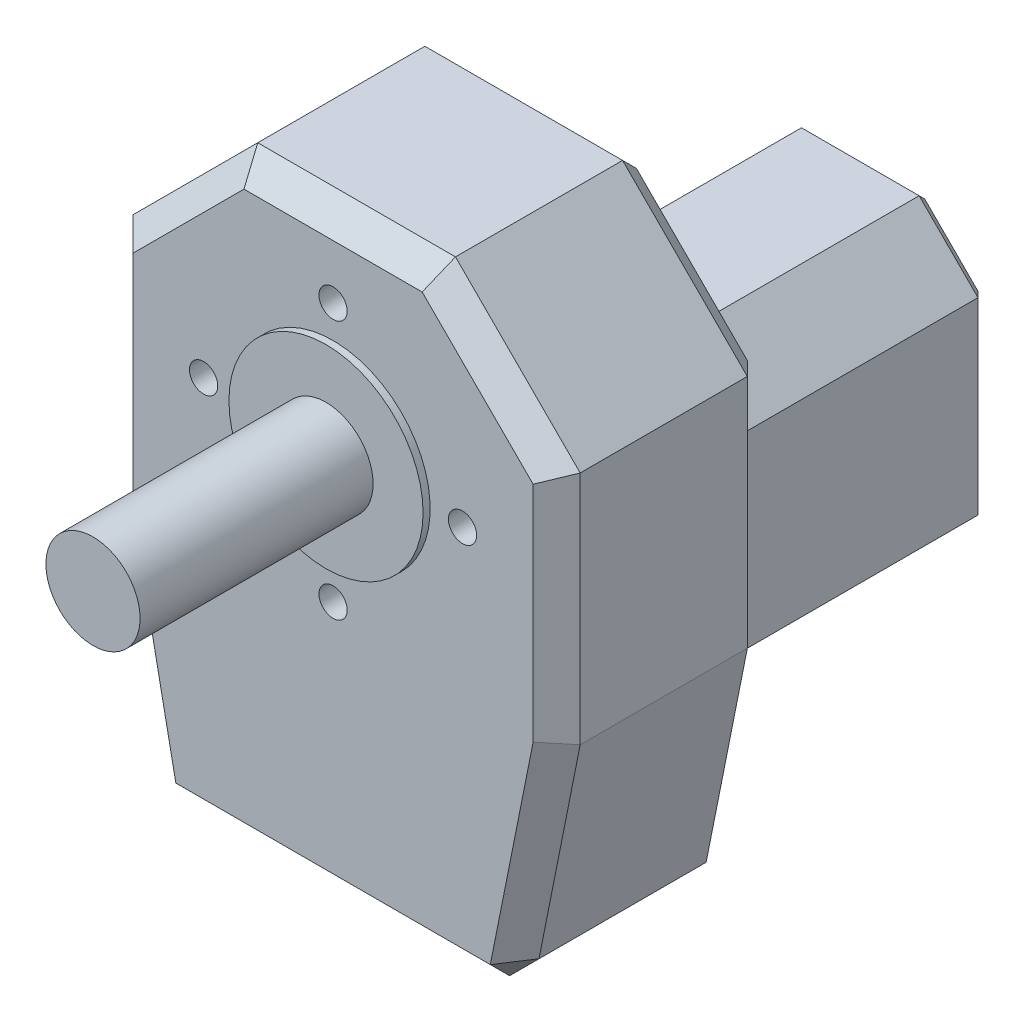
ISO-10303-21;
HEADER;
FILE_DESCRIPTION(('STEP AP214'),'2;1');
FILE_NAME('part.step','',(''),(''),'','','');
FILE_SCHEMA(('AUTOMOTIVE_DESIGN { 1 0 10303 214 1 1 1 1 }'));
ENDSEC;
DATA;
#1=APPLICATION_CONTEXT('core data for automotive mechanical design processes');
#2=APPLICATION_PROTOCOL_DEFINITION('international standard','automotive_design',2000,#1);
#3=PRODUCT_CONTEXT('',#1,'mechanical');
#4=PRODUCT('Part','Part','',(#3));
#5=PRODUCT_RELATED_PRODUCT_CATEGORY('part','',(#4));
#6=PRODUCT_DEFINITION_FORMATION('','',#4);
#7=PRODUCT_DEFINITION_CONTEXT('part definition',#1,'design');
#8=PRODUCT_DEFINITION('design','',#6,#7);
#9=PRODUCT_DEFINITION_SHAPE('','',#8);
#10=(LENGTH_UNIT() NAMED_UNIT(*) SI_UNIT(.MILLI.,.METRE.));
#11=(NAMED_UNIT(*) PLANE_ANGLE_UNIT() SI_UNIT($,.RADIAN.));
#12=(NAMED_UNIT(*) SI_UNIT($,.STERADIAN.) SOLID_ANGLE_UNIT());
#13=UNCERTAINTY_MEASURE_WITH_UNIT(LENGTH_MEASURE(1.E-05),#10,'distance_accuracy_value','');
#14=(GEOMETRIC_REPRESENTATION_CONTEXT(3) GLOBAL_UNCERTAINTY_ASSIGNED_CONTEXT((#13)) GLOBAL_UNIT_ASSIGNED_CONTEXT((#10,
#11,#12)) REPRESENTATION_CONTEXT('',''));
#15=CARTESIAN_POINT('',(0.,0.,0.));
#16=DIRECTION('',(0.,0.,1.));
#17=DIRECTION('',(1.,0.,0.));
#18=AXIS2_PLACEMENT_3D('',#15,#16,#17);
#19=CARTESIAN_POINT('',(-60.,20.,-17.));
#20=DIRECTION('',(0.,0.,-1.));
#21=DIRECTION('',(-1.,0.,0.));
#22=AXIS2_PLACEMENT_3D('',#19,#20,#21);
#23=PLANE('',#22);
#24=DIRECTION('',(0.707106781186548,-0.707106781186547,0.));
#25=VECTOR('',#24,1.);
#26=CARTESIAN_POINT('',(-40.3284271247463,39.6715728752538,-17.));
#27=LINE('',#26,#25);
#28=CARTESIAN_POINT('',(-54.,53.3431457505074,-17.));
#29=VERTEX_POINT('',#28);
#30=CARTESIAN_POINT('',(-26.6568542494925,26.,-17.));
#31=VERTEX_POINT('',#30);
#32=EDGE_CURVE('E494',#29,#31,#27,.T.);
#33=ORIENTED_EDGE('',*,*,#32,.T.);
#34=DIRECTION('',(1.,0.,0.));
#35=VECTOR('',#34,1.);
#36=CARTESIAN_POINT('',(-60.,26.,-17.));
#37=LINE('',#36,#35);
#38=CARTESIAN_POINT('',(26.6568542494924,26.,-17.));
#39=VERTEX_POINT('',#38);
#40=EDGE_CURVE('E496',#31,#39,#37,.T.);
#41=ORIENTED_EDGE('',*,*,#40,.T.);
#42=DIRECTION('',(0.707106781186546,0.707106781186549,0.));
#43=VECTOR('',#42,1.);
#44=CARTESIAN_POINT('',(-19.6715728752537,-20.3284271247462,-17.));
#45=LINE('',#44,#43);
#46=CARTESIAN_POINT('',(54.,53.3431457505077,-17.));
#47=VERTEX_POINT('',#46);
#48=EDGE_CURVE('E482',#39,#47,#45,.T.);
#49=ORIENTED_EDGE('',*,*,#48,.T.);
#50=DIRECTION('',(0.,1.,0.));
#51=VECTOR('',#50,1.);
#52=CARTESIAN_POINT('',(54.,20.,-17.));
#53=LINE('',#52,#51);
#54=CARTESIAN_POINT('',(54.,136.656854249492,-17.));
#55=VERTEX_POINT('',#54);
#56=EDGE_CURVE('E484',#47,#55,#53,.T.);
#57=ORIENTED_EDGE('',*,*,#56,.T.);
#58=DIRECTION('',(-0.707106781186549,0.707106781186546,0.));
#59=VECTOR('',#58,1.);
#60=CARTESIAN_POINT('',(55.328427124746,135.328427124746,-17.));
#61=LINE('',#60,#59);
#62=CARTESIAN_POINT('',(26.6568542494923,164.,-17.));
#63=VERTEX_POINT('',#62);
#64=EDGE_CURVE('E486',#55,#63,#61,.T.);
#65=ORIENTED_EDGE('',*,*,#64,.T.);
#66=DIRECTION('',(-1.,0.,0.));
#67=VECTOR('',#66,1.);
#68=CARTESIAN_POINT('',(-60.,164.,-17.));
#69=LINE('',#68,#67);
#70=CARTESIAN_POINT('',(-26.6568542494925,164.,-17.));
#71=VERTEX_POINT('',#70);
#72=EDGE_CURVE('E488',#63,#71,#69,.T.);
#73=ORIENTED_EDGE('',*,*,#72,.T.);
#74=DIRECTION('',(-0.707106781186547,-0.707106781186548,0.));
#75=VECTOR('',#74,1.);
#76=CARTESIAN_POINT('',(-115.328427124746,75.3284271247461,-17.));
#77=LINE('',#76,#75);
#78=CARTESIAN_POINT('',(-54.,136.656854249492,-17.));
#79=VERTEX_POINT('',#78);
#80=EDGE_CURVE('E490',#71,#79,#77,.T.);
#81=ORIENTED_EDGE('',*,*,#80,.T.);
#82=DIRECTION('',(0.,-1.,0.));
#83=VECTOR('',#82,1.);
#84=CARTESIAN_POINT('',(-54.,20.,-17.));
#85=LINE('',#84,#83);
#86=EDGE_CURVE('E492',#79,#29,#85,.T.);
#87=ORIENTED_EDGE('',*,*,#86,.T.);
#88=EDGE_LOOP('',(#33,#41,#49,#57,#65,#73,#81,#87));
#89=FACE_BOUND('',#88,.T.);
#90=DIRECTION('',(0.,-1.,0.));
#91=VECTOR('',#90,1.);
#92=CARTESIAN_POINT('',(56.,20.,-17.));
#93=LINE('',#92,#91);
#94=CARTESIAN_POINT('',(56.,166.,-17.));
#95=VERTEX_POINT('',#94);
#96=CARTESIAN_POINT('',(56.,24.,-17.));
#97=VERTEX_POINT('',#96);
#98=EDGE_CURVE('E477',#95,#97,#93,.T.);
#99=ORIENTED_EDGE('',*,*,#98,.T.);
#100=DIRECTION('',(-1.,0.,0.));
#101=VECTOR('',#100,1.);
#102=CARTESIAN_POINT('',(-60.,24.,-17.));
#103=LINE('',#102,#101);
#104=CARTESIAN_POINT('',(-56.,24.,-17.));
#105=VERTEX_POINT('',#104);
#106=EDGE_CURVE('E479',#97,#105,#103,.T.);
#107=ORIENTED_EDGE('',*,*,#106,.T.);
#108=DIRECTION('',(0.,1.,0.));
#109=VECTOR('',#108,1.);
#110=CARTESIAN_POINT('',(-56.,170.,-17.));
#111=LINE('',#110,#109);
#112=CARTESIAN_POINT('',(-56.,166.,-17.));
#113=VERTEX_POINT('',#112);
#114=EDGE_CURVE('E473',#105,#113,#111,.T.);
#115=ORIENTED_EDGE('',*,*,#114,.T.);
#116=DIRECTION('',(1.,0.,0.));
#117=VECTOR('',#116,1.);
#118=CARTESIAN_POINT('',(60.,166.,-17.));
#119=LINE('',#118,#117);
#120=EDGE_CURVE('E475',#113,#95,#119,.T.);
#121=ORIENTED_EDGE('',*,*,#120,.T.);
#122=EDGE_LOOP('',(#99,#107,#115,#121));
#123=FACE_BOUND('',#122,.T.);
#124=ADVANCED_FACE('F29',(#89,#123),#23,.T.);
#125=CARTESIAN_POINT('',(-125.6,253.,0.));
#126=DIRECTION('',(0.,0.,-1.));
#127=DIRECTION('',(-1.,0.,0.));
#128=AXIS2_PLACEMENT_3D('',#125,#126,#127);
#129=PLANE('',#128);
#130=DIRECTION('',(0.,-1.,0.));
#131=VECTOR('',#130,1.);
#132=CARTESIAN_POINT('',(85.,100.,0.));
#133=LINE('',#132,#131);
#134=CARTESIAN_POINT('',(85.,195.857864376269,0.));
#135=VERTEX_POINT('',#134);
#136=CARTESIAN_POINT('',(85.,100.990195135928,0.));
#137=VERTEX_POINT('',#136);
#138=EDGE_CURVE('E409',#135,#137,#133,.T.);
#139=ORIENTED_EDGE('',*,*,#138,.T.);
#140=DIRECTION('',(-0.196116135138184,-0.98058067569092,0.));
#141=VECTOR('',#140,1.);
#142=CARTESIAN_POINT('',(65.1941932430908,1.96116135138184,0.));
#143=LINE('',#142,#141);
#144=CARTESIAN_POINT('',(66.8019609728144,10.,0.));
#145=VERTEX_POINT('',#144);
#146=EDGE_CURVE('E411',#137,#145,#143,.T.);
#147=ORIENTED_EDGE('',*,*,#146,.T.);
#148=DIRECTION('',(-1.,0.,0.));
#149=VECTOR('',#148,1.);
#150=CARTESIAN_POINT('',(-75.,10.,0.));
#151=LINE('',#150,#149);
#152=CARTESIAN_POINT('',(-66.8019609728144,10.,0.));
#153=VERTEX_POINT('',#152);
#154=EDGE_CURVE('E397',#145,#153,#151,.T.);
#155=ORIENTED_EDGE('',*,*,#154,.T.);
#156=DIRECTION('',(-0.196116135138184,0.98058067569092,0.));
#157=VECTOR('',#156,1.);
#158=CARTESIAN_POINT('',(-85.1941932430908,101.961161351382,0.));
#159=LINE('',#158,#157);
#160=CARTESIAN_POINT('',(-85.,100.990195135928,0.));
#161=VERTEX_POINT('',#160);
#162=EDGE_CURVE('E399',#153,#161,#159,.T.);
#163=ORIENTED_EDGE('',*,*,#162,.T.);
#164=DIRECTION('',(0.,1.,0.));
#165=VECTOR('',#164,1.);
#166=CARTESIAN_POINT('',(-85.,200.,0.));
#167=LINE('',#166,#165);
#168=CARTESIAN_POINT('',(-85.,195.857864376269,0.));
#169=VERTEX_POINT('',#168);
#170=EDGE_CURVE('E401',#161,#169,#167,.T.);
#171=ORIENTED_EDGE('',*,*,#170,.T.);
#172=DIRECTION('',(0.707106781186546,0.707106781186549,0.));
#173=VECTOR('',#172,1.);
#174=CARTESIAN_POINT('',(-34.9289321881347,245.928932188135,0.));
#175=LINE('',#174,#173);
#176=CARTESIAN_POINT('',(-37.8578643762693,243.,0.));
#177=VERTEX_POINT('',#176);
#178=EDGE_CURVE('E403',#169,#177,#175,.T.);
#179=ORIENTED_EDGE('',*,*,#178,.T.);
#180=DIRECTION('',(1.,0.,0.));
#181=VECTOR('',#180,1.);
#182=CARTESIAN_POINT('',(41.9999999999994,243.,0.));
#183=LINE('',#182,#181);
#184=CARTESIAN_POINT('',(37.8578643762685,243.,0.));
#185=VERTEX_POINT('',#184);
#186=EDGE_CURVE('E405',#177,#185,#183,.T.);
#187=ORIENTED_EDGE('',*,*,#186,.T.);
#188=DIRECTION('',(0.707106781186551,-0.707106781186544,0.));
#189=VECTOR('',#188,1.);
#190=CARTESIAN_POINT('',(87.9289321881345,192.928932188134,0.));
#191=LINE('',#190,#189);
#192=EDGE_CURVE('E407',#185,#135,#191,.T.);
#193=ORIENTED_EDGE('',*,*,#192,.T.);
#194=EDGE_LOOP('',(#139,#147,#155,#163,#171,#179,#187,#193));
#195=FACE_BOUND('',#194,.T.);
#196=DIRECTION('',(1.,0.,0.));
#197=VECTOR('',#196,1.);
#198=CARTESIAN_POINT('',(-60.,170.,0.));
#199=LINE('',#198,#197);
#200=CARTESIAN_POINT('',(-56.,170.,0.));
#201=VERTEX_POINT('',#200);
#202=CARTESIAN_POINT('',(56.,170.,0.));
#203=VERTEX_POINT('',#202);
#204=EDGE_CURVE('E533',#201,#203,#199,.T.);
#205=ORIENTED_EDGE('',*,*,#204,.F.);
#206=DIRECTION('',(0.707106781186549,0.707106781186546,0.));
#207=VECTOR('',#206,1.);
#208=CARTESIAN_POINT('',(-56.,170.,0.));
#209=LINE('',#208,#207);
#210=CARTESIAN_POINT('',(-60.,166.,0.));
#211=VERTEX_POINT('',#210);
#212=EDGE_CURVE('E37',#201,#211,#209,.F.);
#213=ORIENTED_EDGE('',*,*,#212,.T.);
#214=DIRECTION('',(0.,1.,0.));
#215=VECTOR('',#214,1.);
#216=CARTESIAN_POINT('',(-60.,20.,0.));
#217=LINE('',#216,#215);
#218=CARTESIAN_POINT('',(-60.,24.,0.));
#219=VERTEX_POINT('',#218);
#220=EDGE_CURVE('E530',#219,#211,#217,.T.);
#221=ORIENTED_EDGE('',*,*,#220,.F.);
#222=DIRECTION('',(-0.707106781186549,0.707106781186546,0.));
#223=VECTOR('',#222,1.);
#224=CARTESIAN_POINT('',(-60.,24.,0.));
#225=LINE('',#224,#223);
#226=CARTESIAN_POINT('',(-56.,20.,0.));
#227=VERTEX_POINT('',#226);
#228=EDGE_CURVE('E11',#219,#227,#225,.F.);
#229=ORIENTED_EDGE('',*,*,#228,.T.);
#230=DIRECTION('',(-1.,0.,0.));
#231=VECTOR('',#230,1.);
#232=CARTESIAN_POINT('',(-60.,20.,0.));
#233=LINE('',#232,#231);
#234=CARTESIAN_POINT('',(56.,20.,0.));
#235=VERTEX_POINT('',#234);
#236=EDGE_CURVE('E661',#235,#227,#233,.T.);
#237=ORIENTED_EDGE('',*,*,#236,.F.);
#238=DIRECTION('',(-0.707106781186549,-0.707106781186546,0.));
#239=VECTOR('',#238,1.);
#240=CARTESIAN_POINT('',(56.,20.,0.));
#241=LINE('',#240,#239);
#242=CARTESIAN_POINT('',(60.,24.,0.));
#243=VERTEX_POINT('',#242);
#244=EDGE_CURVE('E522',#235,#243,#241,.F.);
#245=ORIENTED_EDGE('',*,*,#244,.T.);
#246=DIRECTION('',(0.,-1.,0.));
#247=VECTOR('',#246,1.);
#248=CARTESIAN_POINT('',(60.,20.,0.));
#249=LINE('',#248,#247);
#250=CARTESIAN_POINT('',(60.,166.,0.));
#251=VERTEX_POINT('',#250);
#252=EDGE_CURVE('E658',#251,#243,#249,.T.);
#253=ORIENTED_EDGE('',*,*,#252,.F.);
#254=DIRECTION('',(0.707106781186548,-0.707106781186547,0.));
#255=VECTOR('',#254,1.);
#256=CARTESIAN_POINT('',(60.,166.,0.));
#257=LINE('',#256,#255);
#258=EDGE_CURVE('E524',#251,#203,#257,.F.);
#259=ORIENTED_EDGE('',*,*,#258,.T.);
#260=EDGE_LOOP('',(#205,#213,#221,#229,#237,#245,#253,#259));
#261=FACE_BOUND('',#260,.T.);
#262=ADVANCED_FACE('F529',(#195,#261),#129,.T.);
#263=CARTESIAN_POINT('',(-125.6,253.,91.));
#264=DIRECTION('',(0.,0.,-1.));
#265=DIRECTION('',(-1.,0.,0.));
#266=AXIS2_PLACEMENT_3D('',#263,#264,#265);
#267=PLANE('',#266);
#268=CARTESIAN_POINT('',(-55.,165.,91.));
#269=DIRECTION('',(0.,0.,1.));
#270=DIRECTION('',(1.,0.,0.));
#271=AXIS2_PLACEMENT_3D('',#268,#269,#270);
#272=CIRCLE('',#271,6.);
#273=CARTESIAN_POINT('',(-49.,165.,91.));
#274=VERTEX_POINT('',#273);
#275=EDGE_CURVE('E668',#274,#274,#272,.T.);
#276=ORIENTED_EDGE('',*,*,#275,.F.);
#277=EDGE_LOOP('',(#276));
#278=FACE_BOUND('',#277,.T.);
#279=CARTESIAN_POINT('',(55.,165.,91.));
#280=DIRECTION('',(0.,0.,1.));
#281=DIRECTION('',(1.,0.,0.));
#282=AXIS2_PLACEMENT_3D('',#279,#280,#281);
#283=CIRCLE('',#282,6.);
#284=CARTESIAN_POINT('',(61.,165.,91.));
#285=VERTEX_POINT('',#284);
#286=EDGE_CURVE('E674',#285,#285,#283,.T.);
#287=ORIENTED_EDGE('',*,*,#286,.F.);
#288=EDGE_LOOP('',(#287));
#289=FACE_BOUND('',#288,.T.);
#290=CARTESIAN_POINT('',(0.,110.,91.));
#291=DIRECTION('',(0.,0.,1.));
#292=DIRECTION('',(1.,0.,0.));
#293=AXIS2_PLACEMENT_3D('',#290,#291,#292);
#294=CIRCLE('',#293,6.00000000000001);
#295=CARTESIAN_POINT('',(6.00000000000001,110.,91.));
#296=VERTEX_POINT('',#295);
#297=EDGE_CURVE('E680',#296,#296,#294,.T.);
#298=ORIENTED_EDGE('',*,*,#297,.F.);
#299=EDGE_LOOP('',(#298));
#300=FACE_BOUND('',#299,.T.);
#301=CARTESIAN_POINT('',(0.,220.,91.));
#302=DIRECTION('',(0.,0.,1.));
#303=DIRECTION('',(1.,0.,0.));
#304=AXIS2_PLACEMENT_3D('',#301,#302,#303);
#305=CIRCLE('',#304,6.00000000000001);
#306=CARTESIAN_POINT('',(6.00000000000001,220.,91.));
#307=VERTEX_POINT('',#306);
#308=EDGE_CURVE('E686',#307,#307,#305,.T.);
#309=ORIENTED_EDGE('',*,*,#308,.F.);
#310=EDGE_LOOP('',(#309));
#311=FACE_BOUND('',#310,.T.);
#312=DIRECTION('',(-0.707106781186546,-0.707106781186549,0.));
#313=VECTOR('',#312,1.);
#314=CARTESIAN_POINT('',(-76.7289321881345,204.128932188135,91.));
#315=LINE('',#314,#313);
#316=CARTESIAN_POINT('',(-37.8578643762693,243.,91.));
#317=VERTEX_POINT('',#316);
#318=CARTESIAN_POINT('',(-85.,195.857864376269,91.));
#319=VERTEX_POINT('',#318);
#320=EDGE_CURVE('E366',#317,#319,#315,.T.);
#321=ORIENTED_EDGE('',*,*,#320,.T.);
#322=DIRECTION('',(0.,-1.,0.));
#323=VECTOR('',#322,1.);
#324=CARTESIAN_POINT('',(-85.,253.,91.));
#325=LINE('',#324,#323);
#326=CARTESIAN_POINT('',(-85.,100.990195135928,91.));
#327=VERTEX_POINT('',#326);
#328=EDGE_CURVE('E368',#319,#327,#325,.T.);
#329=ORIENTED_EDGE('',*,*,#328,.T.);
#330=DIRECTION('',(0.196116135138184,-0.98058067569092,0.));
#331=VECTOR('',#330,1.);
#332=CARTESIAN_POINT('',(-115.794193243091,254.961161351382,91.));
#333=LINE('',#332,#331);
#334=CARTESIAN_POINT('',(-66.8019609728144,10.,91.));
#335=VERTEX_POINT('',#334);
#336=EDGE_CURVE('E356',#327,#335,#333,.T.);
#337=ORIENTED_EDGE('',*,*,#336,.T.);
#338=DIRECTION('',(1.,0.,0.));
#339=VECTOR('',#338,1.);
#340=CARTESIAN_POINT('',(-125.6,10.,91.));
#341=LINE('',#340,#339);
#342=CARTESIAN_POINT('',(66.8019609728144,10.,91.));
#343=VERTEX_POINT('',#342);
#344=EDGE_CURVE('E354',#335,#343,#341,.T.);
#345=ORIENTED_EDGE('',*,*,#344,.T.);
#346=DIRECTION('',(0.196116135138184,0.98058067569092,0.));
#347=VECTOR('',#346,1.);
#348=CARTESIAN_POINT('',(106.132654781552,206.65346904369,91.));
#349=LINE('',#348,#347);
#350=CARTESIAN_POINT('',(85.,100.990195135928,91.));
#351=VERTEX_POINT('',#350);
#352=EDGE_CURVE('E358',#343,#351,#349,.T.);
#353=ORIENTED_EDGE('',*,*,#352,.T.);
#354=DIRECTION('',(0.,1.,0.));
#355=VECTOR('',#354,1.);
#356=CARTESIAN_POINT('',(85.,253.,91.));
#357=LINE('',#356,#355);
#358=CARTESIAN_POINT('',(85.,195.857864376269,91.));
#359=VERTEX_POINT('',#358);
#360=EDGE_CURVE('E360',#351,#359,#357,.T.);
#361=ORIENTED_EDGE('',*,*,#360,.T.);
#362=DIRECTION('',(-0.707106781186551,0.707106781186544,0.));
#363=VECTOR('',#362,1.);
#364=CARTESIAN_POINT('',(-48.8710678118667,329.728932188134,91.));
#365=LINE('',#364,#363);
#366=CARTESIAN_POINT('',(37.8578643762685,243.,91.));
#367=VERTEX_POINT('',#366);
#368=EDGE_CURVE('E362',#359,#367,#365,.T.);
#369=ORIENTED_EDGE('',*,*,#368,.T.);
#370=DIRECTION('',(-1.,0.,0.));
#371=VECTOR('',#370,1.);
#372=CARTESIAN_POINT('',(-125.6,243.,91.));
#373=LINE('',#372,#371);
#374=EDGE_CURVE('E364',#367,#317,#373,.T.);
#375=ORIENTED_EDGE('',*,*,#374,.T.);
#376=EDGE_LOOP('',(#321,#329,#337,#345,#353,#361,#369,#375));
#377=FACE_BOUND('',#376,.T.);
#378=CARTESIAN_POINT('',(0.,165.,91.));
#379=DIRECTION('',(0.,0.,-1.));
#380=DIRECTION('',(-1.,0.,0.));
#381=AXIS2_PLACEMENT_3D('',#378,#379,#380);
#382=CIRCLE('',#381,41.25);
#383=CARTESIAN_POINT('',(-41.25,165.,91.));
#384=VERTEX_POINT('',#383);
#385=EDGE_CURVE('E414',#384,#384,#382,.F.);
#386=ORIENTED_EDGE('',*,*,#385,.F.);
#387=EDGE_LOOP('',(#386));
#388=FACE_BOUND('',#387,.T.);
#389=ADVANCED_FACE('F841',(#278,#289,#300,#311,#377,#388),#267,.F.);
#390=CARTESIAN_POINT('',(-75.,0.,91.));
#391=DIRECTION('',(0.98058067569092,0.196116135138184,0.));
#392=DIRECTION('',(-0.196116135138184,0.98058067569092,0.));
#393=AXIS2_PLACEMENT_3D('',#390,#391,#392);
#394=PLANE('',#393);
#395=DIRECTION('',(0.,0.,1.));
#396=VECTOR('',#395,1.);
#397=CARTESIAN_POINT('',(-76.9611613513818,9.80580675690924,91.));
#398=LINE('',#397,#396);
#399=CARTESIAN_POINT('',(-76.9611613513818,9.80580675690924,10.));
#400=VERTEX_POINT('',#399);
#401=CARTESIAN_POINT('',(-76.9611613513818,9.80580675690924,81.));
#402=VERTEX_POINT('',#401);
#403=EDGE_CURVE('E316',#400,#402,#398,.T.);
#404=ORIENTED_EDGE('',*,*,#403,.T.);
#405=DIRECTION('',(-0.196116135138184,0.98058067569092,0.));
#406=VECTOR('',#405,1.);
#407=CARTESIAN_POINT('',(-75.,0.,81.));
#408=LINE('',#407,#406);
#409=CARTESIAN_POINT('',(-95.,100.,81.));
#410=VERTEX_POINT('',#409);
#411=EDGE_CURVE('E352',#402,#410,#408,.T.);
#412=ORIENTED_EDGE('',*,*,#411,.T.);
#413=DIRECTION('',(0.,0.,-1.));
#414=VECTOR('',#413,1.);
#415=CARTESIAN_POINT('',(-95.,100.,91.));
#416=LINE('',#415,#414);
#417=CARTESIAN_POINT('',(-95.,100.,10.));
#418=VERTEX_POINT('',#417);
#419=EDGE_CURVE('E750',#410,#418,#416,.T.);
#420=ORIENTED_EDGE('',*,*,#419,.T.);
#421=DIRECTION('',(0.196116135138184,-0.98058067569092,0.));
#422=VECTOR('',#421,1.);
#423=CARTESIAN_POINT('',(-75.,0.,10.));
#424=LINE('',#423,#422);
#425=EDGE_CURVE('E345',#418,#400,#424,.T.);
#426=ORIENTED_EDGE('',*,*,#425,.T.);
#427=EDGE_LOOP('',(#404,#412,#420,#426));
#428=FACE_BOUND('',#427,.T.);
#429=ADVANCED_FACE('F31',(#428),#394,.F.);
#430=CARTESIAN_POINT('',(-75.,0.,91.));
#431=DIRECTION('',(0.,1.,0.));
#432=DIRECTION('',(0.,0.,1.));
#433=AXIS2_PLACEMENT_3D('',#430,#431,#432);
#434=PLANE('',#433);
#435=DIRECTION('',(-1.,0.,0.));
#436=VECTOR('',#435,1.);
#437=CARTESIAN_POINT('',(-75.,0.,81.));
#438=LINE('',#437,#436);
#439=CARTESIAN_POINT('',(65.,0.,81.));
#440=VERTEX_POINT('',#439);
#441=CARTESIAN_POINT('',(-62.2524512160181,0.,81.));
#442=VERTEX_POINT('',#441);
#443=EDGE_CURVE('E343',#440,#442,#438,.T.);
#444=ORIENTED_EDGE('',*,*,#443,.T.);
#445=DIRECTION('',(0.,0.,-1.));
#446=VECTOR('',#445,1.);
#447=CARTESIAN_POINT('',(-62.2524512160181,0.,91.));
#448=LINE('',#447,#446);
#449=CARTESIAN_POINT('',(-62.2524512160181,0.,10.));
#450=VERTEX_POINT('',#449);
#451=EDGE_CURVE('E314',#442,#450,#448,.T.);
#452=ORIENTED_EDGE('',*,*,#451,.T.);
#453=DIRECTION('',(1.,0.,0.));
#454=VECTOR('',#453,1.);
#455=CARTESIAN_POINT('',(75.,0.,10.));
#456=LINE('',#455,#454);
#457=CARTESIAN_POINT('',(65.,0.,10.));
#458=VERTEX_POINT('',#457);
#459=EDGE_CURVE('E332',#450,#458,#456,.T.);
#460=ORIENTED_EDGE('',*,*,#459,.T.);
#461=DIRECTION('',(0.,0.,1.));
#462=VECTOR('',#461,1.);
#463=CARTESIAN_POINT('',(65.,0.,91.));
#464=LINE('',#463,#462);
#465=EDGE_CURVE('E338',#458,#440,#464,.T.);
#466=ORIENTED_EDGE('',*,*,#465,.T.);
#467=EDGE_LOOP('',(#444,#452,#460,#466));
#468=FACE_BOUND('',#467,.T.);
#469=ADVANCED_FACE('F341',(#468),#434,.F.);
#470=CARTESIAN_POINT('',(75.,0.,91.));
#471=DIRECTION('',(-0.98058067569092,0.196116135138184,0.));
#472=DIRECTION('',(-0.196116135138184,-0.98058067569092,0.));
#473=AXIS2_PLACEMENT_3D('',#470,#471,#472);
#474=PLANE('',#473);
#475=DIRECTION('',(0.,0.,-1.));
#476=VECTOR('',#475,1.);
#477=CARTESIAN_POINT('',(95.,100.,91.));
#478=LINE('',#477,#476);
#479=CARTESIAN_POINT('',(95.,100.,81.));
#480=VERTEX_POINT('',#479);
#481=CARTESIAN_POINT('',(95.,100.,10.));
#482=VERTEX_POINT('',#481);
#483=EDGE_CURVE('E339',#480,#482,#478,.T.);
#484=ORIENTED_EDGE('',*,*,#483,.F.);
#485=DIRECTION('',(-0.196116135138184,-0.98058067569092,0.));
#486=VECTOR('',#485,1.);
#487=CARTESIAN_POINT('',(75.,0.,81.));
#488=LINE('',#487,#486);
#489=CARTESIAN_POINT('',(77.5,12.5,81.));
#490=VERTEX_POINT('',#489);
#491=EDGE_CURVE('E395',#480,#490,#488,.T.);
#492=ORIENTED_EDGE('',*,*,#491,.T.);
#493=DIRECTION('',(0.,0.,-1.));
#494=VECTOR('',#493,1.);
#495=CARTESIAN_POINT('',(77.5,12.5,91.));
#496=LINE('',#495,#494);
#497=CARTESIAN_POINT('',(77.5,12.5,10.));
#498=VERTEX_POINT('',#497);
#499=EDGE_CURVE('E393',#490,#498,#496,.T.);
#500=ORIENTED_EDGE('',*,*,#499,.T.);
#501=DIRECTION('',(0.196116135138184,0.98058067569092,0.));
#502=VECTOR('',#501,1.);
#503=CARTESIAN_POINT('',(95.,100.,10.));
#504=LINE('',#503,#502);
#505=EDGE_CURVE('E391',#498,#482,#504,.T.);
#506=ORIENTED_EDGE('',*,*,#505,.T.);
#507=EDGE_LOOP('',(#484,#492,#500,#506));
#508=FACE_BOUND('',#507,.T.);
#509=ADVANCED_FACE('F1590',(#508),#474,.F.);
#510=CARTESIAN_POINT('',(95.,100.,91.));
#511=DIRECTION('',(-1.,0.,0.));
#512=DIRECTION('',(0.,0.,1.));
#513=AXIS2_PLACEMENT_3D('',#510,#511,#512);
#514=PLANE('',#513);
#515=DIRECTION('',(0.,0.,-1.));
#516=VECTOR('',#515,1.);
#517=CARTESIAN_POINT('',(95.,200.,91.));
#518=LINE('',#517,#516);
#519=CARTESIAN_POINT('',(95.,200.,81.));
#520=VERTEX_POINT('',#519);
#521=CARTESIAN_POINT('',(95.,200.,10.));
#522=VERTEX_POINT('',#521);
#523=EDGE_CURVE('E762',#520,#522,#518,.T.);
#524=ORIENTED_EDGE('',*,*,#523,.F.);
#525=DIRECTION('',(0.,-1.,0.));
#526=VECTOR('',#525,1.);
#527=CARTESIAN_POINT('',(95.,100.,81.));
#528=LINE('',#527,#526);
#529=EDGE_CURVE('E389',#520,#480,#528,.T.);
#530=ORIENTED_EDGE('',*,*,#529,.T.);
#531=ORIENTED_EDGE('',*,*,#483,.T.);
#532=DIRECTION('',(0.,1.,0.));
#533=VECTOR('',#532,1.);
#534=CARTESIAN_POINT('',(95.,200.,10.));
#535=LINE('',#534,#533);
#536=EDGE_CURVE('E387',#482,#522,#535,.T.);
#537=ORIENTED_EDGE('',*,*,#536,.T.);
#538=EDGE_LOOP('',(#524,#530,#531,#537));
#539=FACE_BOUND('',#538,.T.);
#540=ADVANCED_FACE('F1581',(#539),#514,.F.);
#541=CARTESIAN_POINT('',(95.,200.,91.));
#542=DIRECTION('',(-0.707106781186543,-0.707106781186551,0.));
#543=DIRECTION('',(0.707106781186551,-0.707106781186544,0.));
#544=AXIS2_PLACEMENT_3D('',#541,#542,#543);
#545=PLANE('',#544);
#546=DIRECTION('',(0.,0.,-1.));
#547=VECTOR('',#546,1.);
#548=CARTESIAN_POINT('',(41.9999999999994,253.,91.));
#549=LINE('',#548,#547);
#550=CARTESIAN_POINT('',(41.9999999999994,253.,81.));
#551=VERTEX_POINT('',#550);
#552=CARTESIAN_POINT('',(41.9999999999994,253.,10.));
#553=VERTEX_POINT('',#552);
#554=EDGE_CURVE('E759',#551,#553,#549,.T.);
#555=ORIENTED_EDGE('',*,*,#554,.F.);
#556=DIRECTION('',(0.707106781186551,-0.707106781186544,0.));
#557=VECTOR('',#556,1.);
#558=CARTESIAN_POINT('',(95.,200.,80.9999999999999));
#559=LINE('',#558,#557);
#560=EDGE_CURVE('E385',#551,#520,#559,.T.);
#561=ORIENTED_EDGE('',*,*,#560,.T.);
#562=ORIENTED_EDGE('',*,*,#523,.T.);
#563=DIRECTION('',(-0.707106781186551,0.707106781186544,0.));
#564=VECTOR('',#563,1.);
#565=CARTESIAN_POINT('',(41.9999999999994,253.,10.));
#566=LINE('',#565,#564);
#567=EDGE_CURVE('E383',#522,#553,#566,.T.);
#568=ORIENTED_EDGE('',*,*,#567,.T.);
#569=EDGE_LOOP('',(#555,#561,#562,#568));
#570=FACE_BOUND('',#569,.T.);
#571=ADVANCED_FACE('F1572',(#570),#545,.F.);
#572=CARTESIAN_POINT('',(-42.0000000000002,253.,91.));
#573=DIRECTION('',(0.,-1.,0.));
#574=DIRECTION('',(0.,0.,-1.));
#575=AXIS2_PLACEMENT_3D('',#572,#573,#574);
#576=PLANE('',#575);
#577=DIRECTION('',(0.,0.,-1.));
#578=VECTOR('',#577,1.);
#579=CARTESIAN_POINT('',(-42.0000000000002,253.,91.));
#580=LINE('',#579,#578);
#581=CARTESIAN_POINT('',(-42.0000000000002,253.,81.));
#582=VERTEX_POINT('',#581);
#583=CARTESIAN_POINT('',(-42.0000000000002,253.,10.));
#584=VERTEX_POINT('',#583);
#585=EDGE_CURVE('E756',#582,#584,#580,.T.);
#586=ORIENTED_EDGE('',*,*,#585,.F.);
#587=DIRECTION('',(1.,0.,0.));
#588=VECTOR('',#587,1.);
#589=CARTESIAN_POINT('',(-42.0000000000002,253.,81.));
#590=LINE('',#589,#588);
#591=EDGE_CURVE('E381',#582,#551,#590,.T.);
#592=ORIENTED_EDGE('',*,*,#591,.T.);
#593=ORIENTED_EDGE('',*,*,#554,.T.);
#594=DIRECTION('',(-1.,0.,0.));
#595=VECTOR('',#594,1.);
#596=CARTESIAN_POINT('',(-42.0000000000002,253.,10.));
#597=LINE('',#596,#595);
#598=EDGE_CURVE('E379',#553,#584,#597,.T.);
#599=ORIENTED_EDGE('',*,*,#598,.T.);
#600=EDGE_LOOP('',(#586,#592,#593,#599));
#601=FACE_BOUND('',#600,.T.);
#602=ADVANCED_FACE('F1563',(#601),#576,.F.);
#603=CARTESIAN_POINT('',(-95.,200.,91.));
#604=DIRECTION('',(0.707106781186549,-0.707106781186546,0.));
#605=DIRECTION('',(0.707106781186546,0.707106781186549,0.));
#606=AXIS2_PLACEMENT_3D('',#603,#604,#605);
#607=PLANE('',#606);
#608=DIRECTION('',(0.,0.,-1.));
#609=VECTOR('',#608,1.);
#610=CARTESIAN_POINT('',(-95.,200.,91.));
#611=LINE('',#610,#609);
#612=CARTESIAN_POINT('',(-95.,200.,81.));
#613=VERTEX_POINT('',#612);
#614=CARTESIAN_POINT('',(-95.,200.,10.));
#615=VERTEX_POINT('',#614);
#616=EDGE_CURVE('E753',#613,#615,#611,.T.);
#617=ORIENTED_EDGE('',*,*,#616,.F.);
#618=DIRECTION('',(0.707106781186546,0.707106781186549,0.));
#619=VECTOR('',#618,1.);
#620=CARTESIAN_POINT('',(-95.,200.,81.));
#621=LINE('',#620,#619);
#622=EDGE_CURVE('E377',#613,#582,#621,.T.);
#623=ORIENTED_EDGE('',*,*,#622,.T.);
#624=ORIENTED_EDGE('',*,*,#585,.T.);
#625=DIRECTION('',(-0.707106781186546,-0.707106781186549,0.));
#626=VECTOR('',#625,1.);
#627=CARTESIAN_POINT('',(-95.,200.,10.));
#628=LINE('',#627,#626);
#629=EDGE_CURVE('E375',#584,#615,#628,.T.);
#630=ORIENTED_EDGE('',*,*,#629,.T.);
#631=EDGE_LOOP('',(#617,#623,#624,#630));
#632=FACE_BOUND('',#631,.T.);
#633=ADVANCED_FACE('F1554',(#632),#607,.F.);
#634=CARTESIAN_POINT('',(-95.,100.,91.));
#635=DIRECTION('',(1.,0.,0.));
#636=DIRECTION('',(0.,0.,-1.));
#637=AXIS2_PLACEMENT_3D('',#634,#635,#636);
#638=PLANE('',#637);
#639=ORIENTED_EDGE('',*,*,#419,.F.);
#640=DIRECTION('',(0.,1.,0.));
#641=VECTOR('',#640,1.);
#642=CARTESIAN_POINT('',(-95.,100.,81.));
#643=LINE('',#642,#641);
#644=EDGE_CURVE('E373',#410,#613,#643,.T.);
#645=ORIENTED_EDGE('',*,*,#644,.T.);
#646=ORIENTED_EDGE('',*,*,#616,.T.);
#647=DIRECTION('',(0.,-1.,0.));
#648=VECTOR('',#647,1.);
#649=CARTESIAN_POINT('',(-95.,100.,10.));
#650=LINE('',#649,#648);
#651=EDGE_CURVE('E371',#615,#418,#650,.T.);
#652=ORIENTED_EDGE('',*,*,#651,.T.);
#653=EDGE_LOOP('',(#639,#645,#646,#652));
#654=FACE_BOUND('',#653,.T.);
#655=ADVANCED_FACE('F1545',(#654),#638,.F.);
#656=CARTESIAN_POINT('',(-48.8710678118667,329.728932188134,91.));
#657=DIRECTION('',(-0.499999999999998,-0.500000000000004,-0.707106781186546));
#658=DIRECTION('',(0.,0.816496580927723,-0.57735026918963));
#659=AXIS2_PLACEMENT_3D('',#656,#657,#658);
#660=PLANE('',#659);
#661=DIRECTION('',(-0.678598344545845,-0.281084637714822,0.678598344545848));
#662=VECTOR('',#661,1.);
#663=CARTESIAN_POINT('',(95.8994949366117,200.37258300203,80.1005050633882));
#664=LINE('',#663,#662);
#665=EDGE_CURVE('E744',#520,#359,#664,.T.);
#666=ORIENTED_EDGE('',*,*,#665,.F.);
#667=ORIENTED_EDGE('',*,*,#560,.F.);
#668=DIRECTION('',(-0.281084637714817,-0.678598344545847,0.678598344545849));
#669=VECTOR('',#668,1.);
#670=CARTESIAN_POINT('',(47.5485212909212,266.395315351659,67.6046846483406));
#671=LINE('',#670,#669);
#672=EDGE_CURVE('E747',#367,#551,#671,.F.);
#673=ORIENTED_EDGE('',*,*,#672,.F.);
#674=ORIENTED_EDGE('',*,*,#368,.F.);
#675=EDGE_LOOP('',(#666,#667,#673,#674));
#676=FACE_BOUND('',#675,.T.);
#677=ADVANCED_FACE('F1537',(#676),#660,.F.);
#678=CARTESIAN_POINT('',(95.,200.,10.));
#679=DIRECTION('',(0.499999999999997,0.500000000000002,-0.707106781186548));
#680=DIRECTION('',(0.,0.816496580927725,0.577350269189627));
#681=AXIS2_PLACEMENT_3D('',#678,#679,#680);
#682=PLANE('',#681);
#683=DIRECTION('',(-0.281084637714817,-0.678598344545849,-0.678598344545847));
#684=VECTOR('',#683,1.);
#685=CARTESIAN_POINT('',(35.3632798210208,236.977540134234,-6.02245986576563));
#686=LINE('',#685,#684);
#687=EDGE_CURVE('E738',#553,#185,#686,.T.);
#688=ORIENTED_EDGE('',*,*,#687,.F.);
#689=ORIENTED_EDGE('',*,*,#567,.F.);
#690=DIRECTION('',(-0.678598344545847,-0.281084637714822,-0.678598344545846));
#691=VECTOR('',#690,1.);
#692=CARTESIAN_POINT('',(95.,200.,10.));
#693=LINE('',#692,#691);
#694=EDGE_CURVE('E741',#135,#522,#693,.F.);
#695=ORIENTED_EDGE('',*,*,#694,.F.);
#696=ORIENTED_EDGE('',*,*,#192,.F.);
#697=EDGE_LOOP('',(#688,#689,#695,#696));
#698=FACE_BOUND('',#697,.T.);
#699=ADVANCED_FACE('F812',(#698),#682,.T.);
#700=CARTESIAN_POINT('',(-125.6,243.,91.));
#701=DIRECTION('',(0.,-0.707106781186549,-0.707106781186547));
#702=DIRECTION('',(0.,0.707106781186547,-0.707106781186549));
#703=AXIS2_PLACEMENT_3D('',#700,#701,#702);
#704=PLANE('',#703);
#705=ORIENTED_EDGE('',*,*,#672,.T.);
#706=ORIENTED_EDGE('',*,*,#591,.F.);
#707=DIRECTION('',(0.281084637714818,-0.678598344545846,0.678598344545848));
#708=VECTOR('',#707,1.);
#709=CARTESIAN_POINT('',(-44.7902453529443,259.736248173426,74.2637518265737));
#710=LINE('',#709,#708);
#711=EDGE_CURVE('E735',#317,#582,#710,.F.);
#712=ORIENTED_EDGE('',*,*,#711,.F.);
#713=ORIENTED_EDGE('',*,*,#374,.F.);
#714=EDGE_LOOP('',(#705,#706,#712,#713));
#715=FACE_BOUND('',#714,.T.);
#716=ADVANCED_FACE('F1520',(#715),#704,.F.);
#717=CARTESIAN_POINT('',(85.,253.,91.));
#718=DIRECTION('',(-0.707106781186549,0.,-0.707106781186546));
#719=DIRECTION('',(-0.707106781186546,0.,0.707106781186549));
#720=AXIS2_PLACEMENT_3D('',#717,#718,#719);
#721=PLANE('',#720);
#722=ORIENTED_EDGE('',*,*,#665,.T.);
#723=ORIENTED_EDGE('',*,*,#360,.F.);
#724=DIRECTION('',(-0.705379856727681,0.0698463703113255,0.705379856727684));
#725=VECTOR('',#724,1.);
#726=CARTESIAN_POINT('',(90.3089376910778,100.464506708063,85.6910623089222));
#727=LINE('',#726,#725);
#728=EDGE_CURVE('E732',#480,#351,#727,.T.);
#729=ORIENTED_EDGE('',*,*,#728,.F.);
#730=ORIENTED_EDGE('',*,*,#529,.F.);
#731=EDGE_LOOP('',(#722,#723,#729,#730));
#732=FACE_BOUND('',#731,.T.);
#733=ADVANCED_FACE('F1512',(#732),#721,.F.);
#734=CARTESIAN_POINT('',(95.,100.,10.));
#735=DIRECTION('',(0.707106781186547,0.,-0.707106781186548));
#736=DIRECTION('',(-0.707106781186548,0.,-0.707106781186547));
#737=AXIS2_PLACEMENT_3D('',#734,#735,#736);
#738=PLANE('',#737);
#739=ORIENTED_EDGE('',*,*,#694,.T.);
#740=ORIENTED_EDGE('',*,*,#536,.F.);
#741=DIRECTION('',(-0.705379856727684,0.0698463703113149,-0.705379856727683));
#742=VECTOR('',#741,1.);
#743=CARTESIAN_POINT('',(95.,100.,10.));
#744=LINE('',#743,#742);
#745=EDGE_CURVE('E729',#137,#482,#744,.F.);
#746=ORIENTED_EDGE('',*,*,#745,.F.);
#747=ORIENTED_EDGE('',*,*,#138,.F.);
#748=EDGE_LOOP('',(#739,#740,#746,#747));
#749=FACE_BOUND('',#748,.T.);
#750=ADVANCED_FACE('F819',(#749),#738,.T.);
#751=CARTESIAN_POINT('',(-42.0000000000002,253.,10.));
#752=DIRECTION('',(0.,0.707106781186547,-0.707106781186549));
#753=DIRECTION('',(0.,0.707106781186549,0.707106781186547));
#754=AXIS2_PLACEMENT_3D('',#751,#752,#753);
#755=PLANE('',#754);
#756=ORIENTED_EDGE('',*,*,#687,.T.);
#757=ORIENTED_EDGE('',*,*,#186,.F.);
#758=DIRECTION('',(0.28108463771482,-0.678598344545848,-0.678598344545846));
#759=VECTOR('',#758,1.);
#760=CARTESIAN_POINT('',(-36.0780451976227,238.70313640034,-4.2968635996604));
#761=LINE('',#760,#759);
#762=EDGE_CURVE('E726',#584,#177,#761,.T.);
#763=ORIENTED_EDGE('',*,*,#762,.F.);
#764=ORIENTED_EDGE('',*,*,#598,.F.);
#765=EDGE_LOOP('',(#756,#757,#763,#764));
#766=FACE_BOUND('',#765,.T.);
#767=ADVANCED_FACE('F807',(#766),#755,.T.);
#768=CARTESIAN_POINT('',(-76.7289321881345,204.128932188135,91.));
#769=DIRECTION('',(0.500000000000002,-0.5,-0.707106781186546));
#770=DIRECTION('',(-0.816496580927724,0.,-0.577350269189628));
#771=AXIS2_PLACEMENT_3D('',#768,#769,#770);
#772=PLANE('',#771);
#773=ORIENTED_EDGE('',*,*,#711,.T.);
#774=ORIENTED_EDGE('',*,*,#622,.F.);
#775=DIRECTION('',(0.678598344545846,-0.281084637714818,0.678598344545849));
#776=VECTOR('',#775,1.);
#777=CARTESIAN_POINT('',(-82.7688617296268,194.933696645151,93.2311382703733));
#778=LINE('',#777,#776);
#779=EDGE_CURVE('E723',#319,#613,#778,.F.);
#780=ORIENTED_EDGE('',*,*,#779,.F.);
#781=ORIENTED_EDGE('',*,*,#320,.F.);
#782=EDGE_LOOP('',(#773,#774,#780,#781));
#783=FACE_BOUND('',#782,.T.);
#784=ADVANCED_FACE('F1488',(#783),#772,.F.);
#785=CARTESIAN_POINT('',(106.132654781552,206.65346904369,91.));
#786=DIRECTION('',(-0.693375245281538,0.138675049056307,-0.707106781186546));
#787=DIRECTION('',(-0.714005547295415,0.,0.700140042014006));
#788=AXIS2_PLACEMENT_3D('',#785,#786,#787);
#789=PLANE('',#788);
#790=ORIENTED_EDGE('',*,*,#728,.T.);
#791=ORIENTED_EDGE('',*,*,#352,.F.);
#792=DIRECTION('',(0.720120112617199,0.168283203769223,-0.673132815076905));
#793=VECTOR('',#792,1.);
#794=CARTESIAN_POINT('',(77.5,12.5,81.));
#795=LINE('',#794,#793);
#796=EDGE_CURVE('E720',#490,#343,#795,.F.);
#797=ORIENTED_EDGE('',*,*,#796,.F.);
#798=ORIENTED_EDGE('',*,*,#491,.F.);
#799=EDGE_LOOP('',(#790,#791,#797,#798));
#800=FACE_BOUND('',#799,.T.);
#801=ADVANCED_FACE('F1480',(#800),#789,.F.);
#802=CARTESIAN_POINT('',(77.5,12.5,91.));
#803=DIRECTION('',(-0.707106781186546,0.707106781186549,0.));
#804=DIRECTION('',(-0.707106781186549,-0.707106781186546,0.));
#805=AXIS2_PLACEMENT_3D('',#802,#803,#804);
#806=PLANE('',#805);
#807=DIRECTION('',(0.707106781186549,0.707106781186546,0.));
#808=VECTOR('',#807,1.);
#809=CARTESIAN_POINT('',(77.5,12.5,10.));
#810=LINE('',#809,#808);
#811=EDGE_CURVE('E714',#498,#458,#810,.F.);
#812=ORIENTED_EDGE('',*,*,#811,.F.);
#813=ORIENTED_EDGE('',*,*,#499,.F.);
#814=DIRECTION('',(-0.707106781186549,-0.707106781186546,0.));
#815=VECTOR('',#814,1.);
#816=CARTESIAN_POINT('',(77.5,12.5,81.));
#817=LINE('',#816,#815);
#818=EDGE_CURVE('E717',#440,#490,#817,.F.);
#819=ORIENTED_EDGE('',*,*,#818,.F.);
#820=ORIENTED_EDGE('',*,*,#465,.F.);
#821=EDGE_LOOP('',(#812,#813,#819,#820));
#822=FACE_BOUND('',#821,.T.);
#823=ADVANCED_FACE('F771',(#822),#806,.F.);
#824=CARTESIAN_POINT('',(75.,0.,10.));
#825=DIRECTION('',(0.693375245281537,-0.138675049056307,-0.707106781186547));
#826=DIRECTION('',(-0.714005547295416,0.,-0.700140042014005));
#827=AXIS2_PLACEMENT_3D('',#824,#825,#826);
#828=PLANE('',#827);
#829=ORIENTED_EDGE('',*,*,#745,.T.);
#830=ORIENTED_EDGE('',*,*,#505,.F.);
#831=DIRECTION('',(0.7201201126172,0.168283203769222,0.673132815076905));
#832=VECTOR('',#831,1.);
#833=CARTESIAN_POINT('',(77.5,12.5,10.));
#834=LINE('',#833,#832);
#835=EDGE_CURVE('E711',#145,#498,#834,.T.);
#836=ORIENTED_EDGE('',*,*,#835,.F.);
#837=ORIENTED_EDGE('',*,*,#146,.F.);
#838=EDGE_LOOP('',(#829,#830,#836,#837));
#839=FACE_BOUND('',#838,.T.);
#840=ADVANCED_FACE('F823',(#839),#828,.T.);
#841=CARTESIAN_POINT('',(-95.,200.,10.));
#842=DIRECTION('',(-0.500000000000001,0.499999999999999,-0.707106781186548));
#843=DIRECTION('',(-0.816496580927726,0.,0.577350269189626));
#844=AXIS2_PLACEMENT_3D('',#841,#842,#843);
#845=PLANE('',#844);
#846=ORIENTED_EDGE('',*,*,#762,.T.);
#847=ORIENTED_EDGE('',*,*,#178,.F.);
#848=DIRECTION('',(0.678598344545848,-0.281084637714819,-0.678598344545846));
#849=VECTOR('',#848,1.);
#850=CARTESIAN_POINT('',(-75.9256430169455,192.099142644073,-9.07435698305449));
#851=LINE('',#850,#849);
#852=EDGE_CURVE('E708',#615,#169,#851,.T.);
#853=ORIENTED_EDGE('',*,*,#852,.F.);
#854=ORIENTED_EDGE('',*,*,#629,.F.);
#855=EDGE_LOOP('',(#846,#847,#853,#854));
#856=FACE_BOUND('',#855,.T.);
#857=ADVANCED_FACE('F802',(#856),#845,.T.);
#858=CARTESIAN_POINT('',(-85.,253.,91.));
#859=DIRECTION('',(0.707106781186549,0.,-0.707106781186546));
#860=DIRECTION('',(-0.707106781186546,0.,-0.707106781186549));
#861=AXIS2_PLACEMENT_3D('',#858,#859,#860);
#862=PLANE('',#861);
#863=ORIENTED_EDGE('',*,*,#779,.T.);
#864=ORIENTED_EDGE('',*,*,#644,.F.);
#865=DIRECTION('',(-0.705379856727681,-0.0698463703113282,-0.705379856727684));
#866=VECTOR('',#865,1.);
#867=CARTESIAN_POINT('',(-92.7361057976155,100.224169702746,83.2638942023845));
#868=LINE('',#867,#866);
#869=EDGE_CURVE('E705',#327,#410,#868,.T.);
#870=ORIENTED_EDGE('',*,*,#869,.F.);
#871=ORIENTED_EDGE('',*,*,#328,.F.);
#872=EDGE_LOOP('',(#863,#864,#870,#871));
#873=FACE_BOUND('',#872,.T.);
#874=ADVANCED_FACE('F833',(#873),#862,.F.);
#875=CARTESIAN_POINT('',(77.5,12.5,81.));
#876=DIRECTION('',(0.611752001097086,-0.611752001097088,0.501516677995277));
#877=DIRECTION('',(0.707106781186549,0.707106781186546,0.));
#878=AXIS2_PLACEMENT_3D('',#875,#876,#877);
#879=PLANE('',#878);
#880=ORIENTED_EDGE('',*,*,#818,.T.);
#881=ORIENTED_EDGE('',*,*,#796,.T.);
#882=DIRECTION('',(0.126395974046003,0.701435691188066,0.701435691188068));
#883=VECTOR('',#882,1.);
#884=CARTESIAN_POINT('',(66.3079323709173,7.25838345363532,88.2583834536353));
#885=LINE('',#884,#883);
#886=EDGE_CURVE('E702',#440,#343,#885,.T.);
#887=ORIENTED_EDGE('',*,*,#886,.F.);
#888=EDGE_LOOP('',(#880,#881,#887));
#889=FACE_BOUND('',#888,.T.);
#890=ADVANCED_FACE('F774',(#889),#879,.T.);
#891=CARTESIAN_POINT('',(77.5,12.5,10.));
#892=DIRECTION('',(0.611752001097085,-0.611752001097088,-0.501516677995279));
#893=DIRECTION('',(0.707106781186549,0.707106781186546,0.));
#894=AXIS2_PLACEMENT_3D('',#891,#892,#893);
#895=PLANE('',#894);
#896=ORIENTED_EDGE('',*,*,#835,.T.);
#897=ORIENTED_EDGE('',*,*,#811,.T.);
#898=DIRECTION('',(0.126395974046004,0.701435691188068,-0.701435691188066));
#899=VECTOR('',#898,1.);
#900=CARTESIAN_POINT('',(66.3079323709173,7.25838345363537,2.74161654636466));
#901=LINE('',#900,#899);
#902=EDGE_CURVE('E335',#145,#458,#901,.F.);
#903=ORIENTED_EDGE('',*,*,#902,.F.);
#904=EDGE_LOOP('',(#896,#897,#903));
#905=FACE_BOUND('',#904,.T.);
#906=ADVANCED_FACE('F825',(#905),#895,.T.);
#907=CARTESIAN_POINT('',(-95.,100.,10.));
#908=DIRECTION('',(-0.707106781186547,0.,-0.707106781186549));
#909=DIRECTION('',(-0.707106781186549,0.,0.707106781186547));
#910=AXIS2_PLACEMENT_3D('',#907,#908,#909);
#911=PLANE('',#910);
#912=ORIENTED_EDGE('',*,*,#852,.T.);
#913=ORIENTED_EDGE('',*,*,#170,.F.);
#914=DIRECTION('',(0.705379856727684,0.0698463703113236,-0.705379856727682));
#915=VECTOR('',#914,1.);
#916=CARTESIAN_POINT('',(-89.9756074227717,100.497512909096,4.97560742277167));
#917=LINE('',#916,#915);
#918=EDGE_CURVE('E698',#418,#161,#917,.T.);
#919=ORIENTED_EDGE('',*,*,#918,.F.);
#920=ORIENTED_EDGE('',*,*,#651,.F.);
#921=EDGE_LOOP('',(#912,#913,#919,#920));
#922=FACE_BOUND('',#921,.T.);
#923=ADVANCED_FACE('F797',(#922),#911,.T.);
#924=CARTESIAN_POINT('',(-115.794193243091,254.961161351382,91.));
#925=DIRECTION('',(0.693375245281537,0.138675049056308,-0.707106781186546));
#926=DIRECTION('',(-0.714005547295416,0.,-0.700140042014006));
#927=AXIS2_PLACEMENT_3D('',#924,#925,#926);
#928=PLANE('',#927);
#929=ORIENTED_EDGE('',*,*,#869,.T.);
#930=ORIENTED_EDGE('',*,*,#411,.F.);
#931=DIRECTION('',(0.71260257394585,0.0136214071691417,0.701435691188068));
#932=VECTOR('',#931,1.);
#933=CARTESIAN_POINT('',(-76.9611613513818,9.80580675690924,81.));
#934=LINE('',#933,#932);
#935=EDGE_CURVE('E695',#335,#402,#934,.F.);
#936=ORIENTED_EDGE('',*,*,#935,.F.);
#937=ORIENTED_EDGE('',*,*,#336,.F.);
#938=EDGE_LOOP('',(#929,#930,#936,#937));
#939=FACE_BOUND('',#938,.T.);
#940=ADVANCED_FACE('F784',(#939),#928,.F.);
#941=CARTESIAN_POINT('',(-125.6,10.,91.));
#942=DIRECTION('',(0.,0.707106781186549,-0.707106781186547));
#943=DIRECTION('',(0.,0.707106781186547,0.707106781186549));
#944=AXIS2_PLACEMENT_3D('',#941,#942,#943);
#945=PLANE('',#944);
#946=ORIENTED_EDGE('',*,*,#886,.T.);
#947=ORIENTED_EDGE('',*,*,#344,.F.);
#948=DIRECTION('',(0.306242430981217,-0.673132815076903,-0.673132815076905));
#949=VECTOR('',#948,1.);
#950=CARTESIAN_POINT('',(-65.6532861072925,7.47516781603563,88.4751678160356));
#951=LINE('',#950,#949);
#952=EDGE_CURVE('E329',#442,#335,#951,.F.);
#953=ORIENTED_EDGE('',*,*,#952,.F.);
#954=ORIENTED_EDGE('',*,*,#443,.F.);
#955=EDGE_LOOP('',(#946,#947,#953,#954));
#956=FACE_BOUND('',#955,.T.);
#957=ADVANCED_FACE('F777',(#956),#945,.F.);
#958=CARTESIAN_POINT('',(-75.,0.,10.));
#959=DIRECTION('',(0.,-0.707106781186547,-0.707106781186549));
#960=DIRECTION('',(0.,0.707106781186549,-0.707106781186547));
#961=AXIS2_PLACEMENT_3D('',#958,#959,#960);
#962=PLANE('',#961);
#963=ORIENTED_EDGE('',*,*,#902,.T.);
#964=ORIENTED_EDGE('',*,*,#459,.F.);
#965=DIRECTION('',(0.306242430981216,-0.673132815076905,0.673132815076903));
#966=VECTOR('',#965,1.);
#967=CARTESIAN_POINT('',(-62.2524512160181,0.,10.));
#968=LINE('',#967,#966);
#969=EDGE_CURVE('E323',#153,#450,#968,.T.);
#970=ORIENTED_EDGE('',*,*,#969,.F.);
#971=ORIENTED_EDGE('',*,*,#154,.F.);
#972=EDGE_LOOP('',(#963,#964,#970,#971));
#973=FACE_BOUND('',#972,.T.);
#974=ADVANCED_FACE('F333',(#973),#962,.T.);
#975=CARTESIAN_POINT('',(-75.,0.,10.));
#976=DIRECTION('',(-0.693375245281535,-0.138675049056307,-0.707106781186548));
#977=DIRECTION('',(-0.714005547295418,0.,0.700140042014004));
#978=AXIS2_PLACEMENT_3D('',#975,#976,#977);
#979=PLANE('',#978);
#980=ORIENTED_EDGE('',*,*,#918,.T.);
#981=ORIENTED_EDGE('',*,*,#162,.F.);
#982=DIRECTION('',(0.712602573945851,0.013621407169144,-0.701435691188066));
#983=VECTOR('',#982,1.);
#984=CARTESIAN_POINT('',(-69.5872241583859,9.94675965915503,2.74161654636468));
#985=LINE('',#984,#983);
#986=EDGE_CURVE('E327',#400,#153,#985,.T.);
#987=ORIENTED_EDGE('',*,*,#986,.F.);
#988=ORIENTED_EDGE('',*,*,#425,.F.);
#989=EDGE_LOOP('',(#980,#981,#987,#988));
#990=FACE_BOUND('',#989,.T.);
#991=ADVANCED_FACE('F792',(#990),#979,.T.);
#992=CARTESIAN_POINT('',(-76.9611613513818,9.80580675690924,81.));
#993=DIRECTION('',(-0.479897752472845,-0.719846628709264,0.501516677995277));
#994=DIRECTION('',(0.,-0.571643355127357,-0.820502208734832));
#995=AXIS2_PLACEMENT_3D('',#992,#993,#994);
#996=PLANE('',#995);
#997=ORIENTED_EDGE('',*,*,#952,.T.);
#998=ORIENTED_EDGE('',*,*,#935,.T.);
#999=DIRECTION('',(-0.832050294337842,0.554700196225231,0.));
#1000=VECTOR('',#999,1.);
#1001=CARTESIAN_POINT('',(-76.9611613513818,9.80580675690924,81.));
#1002=LINE('',#1001,#1000);
#1003=EDGE_CURVE('E319',#442,#402,#1002,.T.);
#1004=ORIENTED_EDGE('',*,*,#1003,.F.);
#1005=EDGE_LOOP('',(#997,#998,#1004));
#1006=FACE_BOUND('',#1005,.T.);
#1007=ADVANCED_FACE('F781',(#1006),#996,.T.);
#1008=CARTESIAN_POINT('',(-62.2524512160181,0.,10.));
#1009=DIRECTION('',(-0.479897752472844,-0.719846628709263,-0.50151667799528));
#1010=DIRECTION('',(0.,0.57164335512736,-0.82050220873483));
#1011=AXIS2_PLACEMENT_3D('',#1008,#1009,#1010);
#1012=PLANE('',#1011);
#1013=ORIENTED_EDGE('',*,*,#986,.T.);
#1014=ORIENTED_EDGE('',*,*,#969,.T.);
#1015=DIRECTION('',(0.832050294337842,-0.554700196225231,0.));
#1016=VECTOR('',#1015,1.);
#1017=CARTESIAN_POINT('',(-62.2524512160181,0.,10.));
#1018=LINE('',#1017,#1016);
#1019=EDGE_CURVE('E310',#400,#450,#1018,.T.);
#1020=ORIENTED_EDGE('',*,*,#1019,.F.);
#1021=EDGE_LOOP('',(#1013,#1014,#1020));
#1022=FACE_BOUND('',#1021,.T.);
#1023=ADVANCED_FACE('F325',(#1022),#1012,.T.);
#1024=CARTESIAN_POINT('',(-62.2524512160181,0.,91.));
#1025=DIRECTION('',(0.554700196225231,0.832050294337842,0.));
#1026=DIRECTION('',(-0.832050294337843,0.554700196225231,0.));
#1027=AXIS2_PLACEMENT_3D('',#1024,#1025,#1026);
#1028=PLANE('',#1027);
#1029=ORIENTED_EDGE('',*,*,#1003,.T.);
#1030=ORIENTED_EDGE('',*,*,#403,.F.);
#1031=ORIENTED_EDGE('',*,*,#1019,.T.);
#1032=ORIENTED_EDGE('',*,*,#451,.F.);
#1033=EDGE_LOOP('',(#1029,#1030,#1031,#1032));
#1034=FACE_BOUND('',#1033,.T.);
#1035=ADVANCED_FACE('F312',(#1034),#1028,.F.);
#1036=CARTESIAN_POINT('',(0.,220.,71.));
#1037=DIRECTION('',(0.,0.,1.));
#1038=DIRECTION('',(1.,0.,0.));
#1039=AXIS2_PLACEMENT_3D('',#1036,#1037,#1038);
#1040=CYLINDRICAL_SURFACE('',#1039,6.00000000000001);
#1041=CARTESIAN_POINT('',(0.,220.,71.));
#1042=DIRECTION('',(0.,0.,1.));
#1043=DIRECTION('',(1.,0.,0.));
#1044=AXIS2_PLACEMENT_3D('',#1041,#1042,#1043);
#1045=CIRCLE('',#1044,6.00000000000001);
#1046=CARTESIAN_POINT('',(6.00000000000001,220.,71.));
#1047=VERTEX_POINT('',#1046);
#1048=EDGE_CURVE('E320',#1047,#1047,#1045,.T.);
#1049=ORIENTED_EDGE('',*,*,#1048,.F.);
#1050=EDGE_LOOP('',(#1049));
#1051=FACE_BOUND('',#1050,.T.);
#1052=ORIENTED_EDGE('',*,*,#308,.T.);
#1053=EDGE_LOOP('',(#1052));
#1054=FACE_BOUND('',#1053,.T.);
#1055=ADVANCED_FACE('F905',(#1051,#1054),#1040,.F.);
#1056=CARTESIAN_POINT('',(0.,220.,71.));
#1057=DIRECTION('',(0.,0.,1.));
#1058=DIRECTION('',(1.,0.,0.));
#1059=AXIS2_PLACEMENT_3D('',#1056,#1057,#1058);
#1060=PLANE('',#1059);
#1061=ORIENTED_EDGE('',*,*,#1048,.T.);
#1062=EDGE_LOOP('',(#1061));
#1063=FACE_BOUND('',#1062,.T.);
#1064=ADVANCED_FACE('F901',(#1063),#1060,.T.);
#1065=CARTESIAN_POINT('',(0.,110.,71.));
#1066=DIRECTION('',(0.,0.,1.));
#1067=DIRECTION('',(1.,0.,0.));
#1068=AXIS2_PLACEMENT_3D('',#1065,#1066,#1067);
#1069=CYLINDRICAL_SURFACE('',#1068,6.00000000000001);
#1070=CARTESIAN_POINT('',(0.,110.,71.));
#1071=DIRECTION('',(0.,0.,1.));
#1072=DIRECTION('',(1.,0.,0.));
#1073=AXIS2_PLACEMENT_3D('',#1070,#1071,#1072);
#1074=CIRCLE('',#1073,6.00000000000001);
#1075=CARTESIAN_POINT('',(6.00000000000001,110.,71.));
#1076=VERTEX_POINT('',#1075);
#1077=EDGE_CURVE('E683',#1076,#1076,#1074,.T.);
#1078=ORIENTED_EDGE('',*,*,#1077,.F.);
#1079=EDGE_LOOP('',(#1078));
#1080=FACE_BOUND('',#1079,.T.);
#1081=ORIENTED_EDGE('',*,*,#297,.T.);
#1082=EDGE_LOOP('',(#1081));
#1083=FACE_BOUND('',#1082,.T.);
#1084=ADVANCED_FACE('F897',(#1080,#1083),#1069,.F.);
#1085=CARTESIAN_POINT('',(0.,110.,71.));
#1086=DIRECTION('',(0.,0.,1.));
#1087=DIRECTION('',(1.,0.,0.));
#1088=AXIS2_PLACEMENT_3D('',#1085,#1086,#1087);
#1089=PLANE('',#1088);
#1090=ORIENTED_EDGE('',*,*,#1077,.T.);
#1091=EDGE_LOOP('',(#1090));
#1092=FACE_BOUND('',#1091,.T.);
#1093=ADVANCED_FACE('F893',(#1092),#1089,.T.);
#1094=CARTESIAN_POINT('',(55.,165.,71.));
#1095=DIRECTION('',(0.,0.,1.));
#1096=DIRECTION('',(1.,0.,0.));
#1097=AXIS2_PLACEMENT_3D('',#1094,#1095,#1096);
#1098=CYLINDRICAL_SURFACE('',#1097,6.);
#1099=CARTESIAN_POINT('',(55.,165.,71.));
#1100=DIRECTION('',(0.,0.,1.));
#1101=DIRECTION('',(1.,0.,0.));
#1102=AXIS2_PLACEMENT_3D('',#1099,#1100,#1101);
#1103=CIRCLE('',#1102,6.);
#1104=CARTESIAN_POINT('',(61.,165.,71.));
#1105=VERTEX_POINT('',#1104);
#1106=EDGE_CURVE('E677',#1105,#1105,#1103,.T.);
#1107=ORIENTED_EDGE('',*,*,#1106,.F.);
#1108=EDGE_LOOP('',(#1107));
#1109=FACE_BOUND('',#1108,.T.);
#1110=ORIENTED_EDGE('',*,*,#286,.T.);
#1111=EDGE_LOOP('',(#1110));
#1112=FACE_BOUND('',#1111,.T.);
#1113=ADVANCED_FACE('F889',(#1109,#1112),#1098,.F.);
#1114=CARTESIAN_POINT('',(55.,165.,71.));
#1115=DIRECTION('',(0.,0.,1.));
#1116=DIRECTION('',(1.,0.,0.));
#1117=AXIS2_PLACEMENT_3D('',#1114,#1115,#1116);
#1118=PLANE('',#1117);
#1119=ORIENTED_EDGE('',*,*,#1106,.T.);
#1120=EDGE_LOOP('',(#1119));
#1121=FACE_BOUND('',#1120,.T.);
#1122=ADVANCED_FACE('F885',(#1121),#1118,.T.);
#1123=CARTESIAN_POINT('',(-55.,165.,71.));
#1124=DIRECTION('',(0.,0.,1.));
#1125=DIRECTION('',(1.,0.,0.));
#1126=AXIS2_PLACEMENT_3D('',#1123,#1124,#1125);
#1127=CYLINDRICAL_SURFACE('',#1126,6.);
#1128=CARTESIAN_POINT('',(-55.,165.,71.));
#1129=DIRECTION('',(0.,0.,1.));
#1130=DIRECTION('',(1.,0.,0.));
#1131=AXIS2_PLACEMENT_3D('',#1128,#1129,#1130);
#1132=CIRCLE('',#1131,6.);
#1133=CARTESIAN_POINT('',(-49.,165.,71.));
#1134=VERTEX_POINT('',#1133);
#1135=EDGE_CURVE('E671',#1134,#1134,#1132,.T.);
#1136=ORIENTED_EDGE('',*,*,#1135,.F.);
#1137=EDGE_LOOP('',(#1136));
#1138=FACE_BOUND('',#1137,.T.);
#1139=ORIENTED_EDGE('',*,*,#275,.T.);
#1140=EDGE_LOOP('',(#1139));
#1141=FACE_BOUND('',#1140,.T.);
#1142=ADVANCED_FACE('F881',(#1138,#1141),#1127,.F.);
#1143=CARTESIAN_POINT('',(-55.,165.,71.));
#1144=DIRECTION('',(0.,0.,1.));
#1145=DIRECTION('',(1.,0.,0.));
#1146=AXIS2_PLACEMENT_3D('',#1143,#1144,#1145);
#1147=PLANE('',#1146);
#1148=ORIENTED_EDGE('',*,*,#1135,.T.);
#1149=EDGE_LOOP('',(#1148));
#1150=FACE_BOUND('',#1149,.T.);
#1151=ADVANCED_FACE('F867',(#1150),#1147,.T.);
#1152=CARTESIAN_POINT('',(0.,165.,94.));
#1153=DIRECTION('',(0.,0.,1.));
#1154=DIRECTION('',(1.,0.,0.));
#1155=AXIS2_PLACEMENT_3D('',#1152,#1153,#1154);
#1156=PLANE('',#1155);
#1157=CARTESIAN_POINT('',(0.,165.,94.));
#1158=DIRECTION('',(0.,0.,1.));
#1159=DIRECTION('',(1.,0.,0.));
#1160=AXIS2_PLACEMENT_3D('',#1157,#1158,#1159);
#1161=CIRCLE('',#1160,41.25);
#1162=CARTESIAN_POINT('',(41.25,165.,94.));
#1163=VERTEX_POINT('',#1162);
#1164=EDGE_CURVE('E419',#1163,#1163,#1161,.T.);
#1165=ORIENTED_EDGE('',*,*,#1164,.T.);
#1166=EDGE_LOOP('',(#1165));
#1167=FACE_BOUND('',#1166,.T.);
#1168=CARTESIAN_POINT('',(0.,165.,94.));
#1169=DIRECTION('',(0.,0.,1.));
#1170=DIRECTION('',(1.,0.,0.));
#1171=AXIS2_PLACEMENT_3D('',#1168,#1169,#1170);
#1172=CIRCLE('',#1171,20.);
#1173=CARTESIAN_POINT('',(20.,165.,94.));
#1174=VERTEX_POINT('',#1173);
#1175=EDGE_CURVE('E415',#1174,#1174,#1172,.T.);
#1176=ORIENTED_EDGE('',*,*,#1175,.F.);
#1177=EDGE_LOOP('',(#1176));
#1178=FACE_BOUND('',#1177,.T.);
#1179=ADVANCED_FACE('F863',(#1167,#1178),#1156,.T.);
#1180=CARTESIAN_POINT('',(0.,165.,94.));
#1181=DIRECTION('',(0.,0.,-1.));
#1182=DIRECTION('',(-1.,0.,0.));
#1183=AXIS2_PLACEMENT_3D('',#1180,#1181,#1182);
#1184=CYLINDRICAL_SURFACE('',#1183,41.25);
#1185=ORIENTED_EDGE('',*,*,#1164,.F.);
#1186=EDGE_LOOP('',(#1185));
#1187=FACE_BOUND('',#1186,.T.);
#1188=ORIENTED_EDGE('',*,*,#385,.T.);
#1189=EDGE_LOOP('',(#1188));
#1190=FACE_BOUND('',#1189,.T.);
#1191=ADVANCED_FACE('F866',(#1187,#1190),#1184,.T.);
#1192=CARTESIAN_POINT('',(0.,165.,193.));
#1193=DIRECTION('',(0.,0.,1.));
#1194=DIRECTION('',(1.,0.,0.));
#1195=AXIS2_PLACEMENT_3D('',#1192,#1193,#1194);
#1196=PLANE('',#1195);
#1197=CARTESIAN_POINT('',(0.,165.,193.));
#1198=DIRECTION('',(0.,0.,1.));
#1199=DIRECTION('',(1.,0.,0.));
#1200=AXIS2_PLACEMENT_3D('',#1197,#1198,#1199);
#1201=CIRCLE('',#1200,20.);
#1202=CARTESIAN_POINT('',(20.,165.,193.));
#1203=VERTEX_POINT('',#1202);
#1204=EDGE_CURVE('E418',#1203,#1203,#1201,.T.);
#1205=ORIENTED_EDGE('',*,*,#1204,.T.);
#1206=EDGE_LOOP('',(#1205));
#1207=FACE_BOUND('',#1206,.T.);
#1208=ADVANCED_FACE('F871',(#1207),#1196,.T.);
#1209=CARTESIAN_POINT('',(0.,165.,193.));
#1210=DIRECTION('',(0.,0.,-1.));
#1211=DIRECTION('',(-1.,0.,0.));
#1212=AXIS2_PLACEMENT_3D('',#1209,#1210,#1211);
#1213=CYLINDRICAL_SURFACE('',#1212,20.);
#1214=ORIENTED_EDGE('',*,*,#1175,.T.);
#1215=EDGE_LOOP('',(#1214));
#1216=FACE_BOUND('',#1215,.T.);
#1217=ORIENTED_EDGE('',*,*,#1204,.F.);
#1218=EDGE_LOOP('',(#1217));
#1219=FACE_BOUND('',#1218,.T.);
#1220=ADVANCED_FACE('F862',(#1216,#1219),#1213,.T.);
#1221=CARTESIAN_POINT('',(-60.,20.,-17.));
#1222=DIRECTION('',(1.,0.,0.));
#1223=DIRECTION('',(0.,0.,-1.));
#1224=AXIS2_PLACEMENT_3D('',#1221,#1222,#1223);
#1225=PLANE('',#1224);
#1226=ORIENTED_EDGE('',*,*,#220,.T.);
#1227=DIRECTION('',(0.,0.,-1.));
#1228=VECTOR('',#1227,1.);
#1229=CARTESIAN_POINT('',(-60.,166.,-17.));
#1230=LINE('',#1229,#1228);
#1231=CARTESIAN_POINT('',(-60.,166.,-13.));
#1232=VERTEX_POINT('',#1231);
#1233=EDGE_CURVE('E44',#211,#1232,#1230,.T.);
#1234=ORIENTED_EDGE('',*,*,#1233,.T.);
#1235=DIRECTION('',(0.,-1.,0.));
#1236=VECTOR('',#1235,1.);
#1237=CARTESIAN_POINT('',(-60.,20.,-13.));
#1238=LINE('',#1237,#1236);
#1239=CARTESIAN_POINT('',(-60.,24.,-13.));
#1240=VERTEX_POINT('',#1239);
#1241=EDGE_CURVE('E49',#1232,#1240,#1238,.T.);
#1242=ORIENTED_EDGE('',*,*,#1241,.T.);
#1243=DIRECTION('',(0.,0.,1.));
#1244=VECTOR('',#1243,1.);
#1245=CARTESIAN_POINT('',(-60.,24.,-17.));
#1246=LINE('',#1245,#1244);
#1247=EDGE_CURVE('E518',#1240,#219,#1246,.T.);
#1248=ORIENTED_EDGE('',*,*,#1247,.T.);
#1249=EDGE_LOOP('',(#1226,#1234,#1242,#1248));
#1250=FACE_BOUND('',#1249,.T.);
#1251=ADVANCED_FACE('F536',(#1250),#1225,.F.);
#1252=CARTESIAN_POINT('',(-60.,170.,-17.));
#1253=DIRECTION('',(0.,-1.,0.));
#1254=DIRECTION('',(1.,0.,0.));
#1255=AXIS2_PLACEMENT_3D('',#1252,#1253,#1254);
#1256=PLANE('',#1255);
#1257=ORIENTED_EDGE('',*,*,#204,.T.);
#1258=DIRECTION('',(0.,0.,-1.));
#1259=VECTOR('',#1258,1.);
#1260=CARTESIAN_POINT('',(56.,170.,-17.));
#1261=LINE('',#1260,#1259);
#1262=CARTESIAN_POINT('',(56.,170.,-13.));
#1263=VERTEX_POINT('',#1262);
#1264=EDGE_CURVE('E516',#203,#1263,#1261,.T.);
#1265=ORIENTED_EDGE('',*,*,#1264,.T.);
#1266=DIRECTION('',(-1.,0.,0.));
#1267=VECTOR('',#1266,1.);
#1268=CARTESIAN_POINT('',(-60.,170.,-13.));
#1269=LINE('',#1268,#1267);
#1270=CARTESIAN_POINT('',(-56.,170.,-13.));
#1271=VERTEX_POINT('',#1270);
#1272=EDGE_CURVE('E514',#1263,#1271,#1269,.T.);
#1273=ORIENTED_EDGE('',*,*,#1272,.T.);
#1274=DIRECTION('',(0.,0.,1.));
#1275=VECTOR('',#1274,1.);
#1276=CARTESIAN_POINT('',(-56.,170.,-17.));
#1277=LINE('',#1276,#1275);
#1278=EDGE_CURVE('E512',#1271,#201,#1277,.T.);
#1279=ORIENTED_EDGE('',*,*,#1278,.T.);
#1280=EDGE_LOOP('',(#1257,#1265,#1273,#1279));
#1281=FACE_BOUND('',#1280,.T.);
#1282=ADVANCED_FACE('F855',(#1281),#1256,.F.);
#1283=CARTESIAN_POINT('',(60.,20.,-17.));
#1284=DIRECTION('',(-1.,0.,0.));
#1285=DIRECTION('',(0.,-1.,0.));
#1286=AXIS2_PLACEMENT_3D('',#1283,#1284,#1285);
#1287=PLANE('',#1286);
#1288=ORIENTED_EDGE('',*,*,#252,.T.);
#1289=DIRECTION('',(0.,0.,-1.));
#1290=VECTOR('',#1289,1.);
#1291=CARTESIAN_POINT('',(60.,24.,-17.));
#1292=LINE('',#1291,#1290);
#1293=CARTESIAN_POINT('',(60.,24.,-13.));
#1294=VERTEX_POINT('',#1293);
#1295=EDGE_CURVE('E510',#243,#1294,#1292,.T.);
#1296=ORIENTED_EDGE('',*,*,#1295,.T.);
#1297=DIRECTION('',(0.,1.,0.));
#1298=VECTOR('',#1297,1.);
#1299=CARTESIAN_POINT('',(60.,170.,-13.));
#1300=LINE('',#1299,#1298);
#1301=CARTESIAN_POINT('',(60.,166.,-13.));
#1302=VERTEX_POINT('',#1301);
#1303=EDGE_CURVE('E508',#1294,#1302,#1300,.T.);
#1304=ORIENTED_EDGE('',*,*,#1303,.T.);
#1305=DIRECTION('',(0.,0.,1.));
#1306=VECTOR('',#1305,1.);
#1307=CARTESIAN_POINT('',(60.,166.,-17.));
#1308=LINE('',#1307,#1306);
#1309=EDGE_CURVE('E506',#1302,#251,#1308,.T.);
#1310=ORIENTED_EDGE('',*,*,#1309,.T.);
#1311=EDGE_LOOP('',(#1288,#1296,#1304,#1310));
#1312=FACE_BOUND('',#1311,.T.);
#1313=ADVANCED_FACE('F851',(#1312),#1287,.F.);
#1314=CARTESIAN_POINT('',(-60.,20.,-17.));
#1315=DIRECTION('',(0.,1.,0.));
#1316=DIRECTION('',(-1.,0.,0.));
#1317=AXIS2_PLACEMENT_3D('',#1314,#1315,#1316);
#1318=PLANE('',#1317);
#1319=DIRECTION('',(1.,0.,0.));
#1320=VECTOR('',#1319,1.);
#1321=CARTESIAN_POINT('',(60.,20.,-13.));
#1322=LINE('',#1321,#1320);
#1323=CARTESIAN_POINT('',(-56.,20.,-13.));
#1324=VERTEX_POINT('',#1323);
#1325=CARTESIAN_POINT('',(56.,20.,-13.));
#1326=VERTEX_POINT('',#1325);
#1327=EDGE_CURVE('E501',#1324,#1326,#1322,.T.);
#1328=ORIENTED_EDGE('',*,*,#1327,.T.);
#1329=DIRECTION('',(0.,0.,1.));
#1330=VECTOR('',#1329,1.);
#1331=CARTESIAN_POINT('',(56.,20.,-17.));
#1332=LINE('',#1331,#1330);
#1333=EDGE_CURVE('E504',#1326,#235,#1332,.T.);
#1334=ORIENTED_EDGE('',*,*,#1333,.T.);
#1335=ORIENTED_EDGE('',*,*,#236,.T.);
#1336=DIRECTION('',(0.,0.,-1.));
#1337=VECTOR('',#1336,1.);
#1338=CARTESIAN_POINT('',(-56.,20.,-17.));
#1339=LINE('',#1338,#1337);
#1340=EDGE_CURVE('E499',#227,#1324,#1339,.T.);
#1341=ORIENTED_EDGE('',*,*,#1340,.T.);
#1342=EDGE_LOOP('',(#1328,#1334,#1335,#1341));
#1343=FACE_BOUND('',#1342,.T.);
#1344=ADVANCED_FACE('F848',(#1343),#1318,.F.);
#1345=CARTESIAN_POINT('',(50.,135.,-137.));
#1346=DIRECTION('',(-1.,0.,0.));
#1347=DIRECTION('',(0.,-1.,0.));
#1348=AXIS2_PLACEMENT_3D('',#1345,#1346,#1347);
#1349=PLANE('',#1348);
#1350=DIRECTION('',(0.,0.,1.));
#1351=VECTOR('',#1350,1.);
#1352=CARTESIAN_POINT('',(50.,55.0000000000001,-137.));
#1353=LINE('',#1352,#1351);
#1354=CARTESIAN_POINT('',(50.,55.0000000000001,-133.));
#1355=VERTEX_POINT('',#1354);
#1356=CARTESIAN_POINT('',(50.,55.0000000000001,-21.));
#1357=VERTEX_POINT('',#1356);
#1358=EDGE_CURVE('E537',#1355,#1357,#1353,.T.);
#1359=ORIENTED_EDGE('',*,*,#1358,.F.);
#1360=DIRECTION('',(0.,1.,0.));
#1361=VECTOR('',#1360,1.);
#1362=CARTESIAN_POINT('',(50.,135.,-133.));
#1363=LINE('',#1362,#1361);
#1364=CARTESIAN_POINT('',(50.,135.,-133.));
#1365=VERTEX_POINT('',#1364);
#1366=EDGE_CURVE('E471',#1355,#1365,#1363,.T.);
#1367=ORIENTED_EDGE('',*,*,#1366,.T.);
#1368=DIRECTION('',(0.,0.,1.));
#1369=VECTOR('',#1368,1.);
#1370=CARTESIAN_POINT('',(50.,135.,-137.));
#1371=LINE('',#1370,#1369);
#1372=CARTESIAN_POINT('',(50.,135.,-21.));
#1373=VERTEX_POINT('',#1372);
#1374=EDGE_CURVE('E634',#1365,#1373,#1371,.T.);
#1375=ORIENTED_EDGE('',*,*,#1374,.T.);
#1376=DIRECTION('',(0.,-1.,0.));
#1377=VECTOR('',#1376,1.);
#1378=CARTESIAN_POINT('',(50.,135.,-21.));
#1379=LINE('',#1378,#1377);
#1380=EDGE_CURVE('E469',#1373,#1357,#1379,.T.);
#1381=ORIENTED_EDGE('',*,*,#1380,.T.);
#1382=EDGE_LOOP('',(#1359,#1367,#1375,#1381));
#1383=FACE_BOUND('',#1382,.T.);
#1384=ADVANCED_FACE('F846',(#1383),#1349,.F.);
#1385=CARTESIAN_POINT('',(50.,55.0000000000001,-137.));
#1386=DIRECTION('',(-0.707106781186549,0.707106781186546,0.));
#1387=DIRECTION('',(-0.707106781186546,-0.707106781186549,0.));
#1388=AXIS2_PLACEMENT_3D('',#1385,#1386,#1387);
#1389=PLANE('',#1388);
#1390=DIRECTION('',(0.,0.,1.));
#1391=VECTOR('',#1390,1.);
#1392=CARTESIAN_POINT('',(25.,30.,-137.));
#1393=LINE('',#1392,#1391);
#1394=CARTESIAN_POINT('',(25.,30.,-133.));
#1395=VERTEX_POINT('',#1394);
#1396=CARTESIAN_POINT('',(25.,30.,-21.));
#1397=VERTEX_POINT('',#1396);
#1398=EDGE_CURVE('E652',#1395,#1397,#1393,.T.);
#1399=ORIENTED_EDGE('',*,*,#1398,.F.);
#1400=DIRECTION('',(0.707106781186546,0.707106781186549,0.));
#1401=VECTOR('',#1400,1.);
#1402=CARTESIAN_POINT('',(50.,55.0000000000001,-133.));
#1403=LINE('',#1402,#1401);
#1404=EDGE_CURVE('E467',#1395,#1355,#1403,.T.);
#1405=ORIENTED_EDGE('',*,*,#1404,.T.);
#1406=ORIENTED_EDGE('',*,*,#1358,.T.);
#1407=DIRECTION('',(-0.707106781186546,-0.707106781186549,0.));
#1408=VECTOR('',#1407,1.);
#1409=CARTESIAN_POINT('',(50.,55.0000000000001,-21.));
#1410=LINE('',#1409,#1408);
#1411=EDGE_CURVE('E465',#1357,#1397,#1410,.T.);
#1412=ORIENTED_EDGE('',*,*,#1411,.T.);
#1413=EDGE_LOOP('',(#1399,#1405,#1406,#1412));
#1414=FACE_BOUND('',#1413,.T.);
#1415=ADVANCED_FACE('F1021',(#1414),#1389,.F.);
#1416=CARTESIAN_POINT('',(25.,30.,-137.));
#1417=DIRECTION('',(0.,1.,0.));
#1418=DIRECTION('',(-1.,0.,0.));
#1419=AXIS2_PLACEMENT_3D('',#1416,#1417,#1418);
#1420=PLANE('',#1419);
#1421=DIRECTION('',(0.,0.,1.));
#1422=VECTOR('',#1421,1.);
#1423=CARTESIAN_POINT('',(-25.0000000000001,30.,-137.));
#1424=LINE('',#1423,#1422);
#1425=CARTESIAN_POINT('',(-25.0000000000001,30.,-133.));
#1426=VERTEX_POINT('',#1425);
#1427=CARTESIAN_POINT('',(-25.0000000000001,30.,-21.));
#1428=VERTEX_POINT('',#1427);
#1429=EDGE_CURVE('E649',#1426,#1428,#1424,.T.);
#1430=ORIENTED_EDGE('',*,*,#1429,.F.);
#1431=DIRECTION('',(1.,0.,0.));
#1432=VECTOR('',#1431,1.);
#1433=CARTESIAN_POINT('',(25.,30.,-133.));
#1434=LINE('',#1433,#1432);
#1435=EDGE_CURVE('E463',#1426,#1395,#1434,.T.);
#1436=ORIENTED_EDGE('',*,*,#1435,.T.);
#1437=ORIENTED_EDGE('',*,*,#1398,.T.);
#1438=DIRECTION('',(-1.,0.,0.));
#1439=VECTOR('',#1438,1.);
#1440=CARTESIAN_POINT('',(25.,30.,-21.));
#1441=LINE('',#1440,#1439);
#1442=EDGE_CURVE('E460',#1397,#1428,#1441,.T.);
#1443=ORIENTED_EDGE('',*,*,#1442,.T.);
#1444=EDGE_LOOP('',(#1430,#1436,#1437,#1443));
#1445=FACE_BOUND('',#1444,.T.);
#1446=ADVANCED_FACE('F1028',(#1445),#1420,.F.);
#1447=CARTESIAN_POINT('',(-25.0000000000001,30.,-137.));
#1448=DIRECTION('',(0.707106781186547,0.707106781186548,0.));
#1449=DIRECTION('',(-0.707106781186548,0.707106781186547,0.));
#1450=AXIS2_PLACEMENT_3D('',#1447,#1448,#1449);
#1451=PLANE('',#1450);
#1452=DIRECTION('',(0.,0.,1.));
#1453=VECTOR('',#1452,1.);
#1454=CARTESIAN_POINT('',(-50.,54.9999999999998,-137.));
#1455=LINE('',#1454,#1453);
#1456=CARTESIAN_POINT('',(-50.,54.9999999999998,-133.));
#1457=VERTEX_POINT('',#1456);
#1458=CARTESIAN_POINT('',(-50.,54.9999999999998,-21.));
#1459=VERTEX_POINT('',#1458);
#1460=EDGE_CURVE('E646',#1457,#1459,#1455,.T.);
#1461=ORIENTED_EDGE('',*,*,#1460,.F.);
#1462=DIRECTION('',(0.707106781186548,-0.707106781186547,0.));
#1463=VECTOR('',#1462,1.);
#1464=CARTESIAN_POINT('',(-25.0000000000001,30.,-133.));
#1465=LINE('',#1464,#1463);
#1466=EDGE_CURVE('E458',#1457,#1426,#1465,.T.);
#1467=ORIENTED_EDGE('',*,*,#1466,.T.);
#1468=ORIENTED_EDGE('',*,*,#1429,.T.);
#1469=DIRECTION('',(-0.707106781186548,0.707106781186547,0.));
#1470=VECTOR('',#1469,1.);
#1471=CARTESIAN_POINT('',(-25.0000000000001,30.,-21.));
#1472=LINE('',#1471,#1470);
#1473=EDGE_CURVE('E456',#1428,#1459,#1472,.T.);
#1474=ORIENTED_EDGE('',*,*,#1473,.T.);
#1475=EDGE_LOOP('',(#1461,#1467,#1468,#1474));
#1476=FACE_BOUND('',#1475,.T.);
#1477=ADVANCED_FACE('F1035',(#1476),#1451,.F.);
#1478=CARTESIAN_POINT('',(-50.,54.9999999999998,-137.));
#1479=DIRECTION('',(1.,0.,0.));
#1480=DIRECTION('',(0.,1.,0.));
#1481=AXIS2_PLACEMENT_3D('',#1478,#1479,#1480);
#1482=PLANE('',#1481);
#1483=DIRECTION('',(0.,0.,1.));
#1484=VECTOR('',#1483,1.);
#1485=CARTESIAN_POINT('',(-50.,135.,-137.));
#1486=LINE('',#1485,#1484);
#1487=CARTESIAN_POINT('',(-50.,135.,-133.));
#1488=VERTEX_POINT('',#1487);
#1489=CARTESIAN_POINT('',(-50.,135.,-21.));
#1490=VERTEX_POINT('',#1489);
#1491=EDGE_CURVE('E643',#1488,#1490,#1486,.T.);
#1492=ORIENTED_EDGE('',*,*,#1491,.F.);
#1493=DIRECTION('',(0.,-1.,0.));
#1494=VECTOR('',#1493,1.);
#1495=CARTESIAN_POINT('',(-50.,54.9999999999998,-133.));
#1496=LINE('',#1495,#1494);
#1497=EDGE_CURVE('E454',#1488,#1457,#1496,.T.);
#1498=ORIENTED_EDGE('',*,*,#1497,.T.);
#1499=ORIENTED_EDGE('',*,*,#1460,.T.);
#1500=DIRECTION('',(0.,1.,0.));
#1501=VECTOR('',#1500,1.);
#1502=CARTESIAN_POINT('',(-50.,54.9999999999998,-21.));
#1503=LINE('',#1502,#1501);
#1504=EDGE_CURVE('E452',#1459,#1490,#1503,.T.);
#1505=ORIENTED_EDGE('',*,*,#1504,.T.);
#1506=EDGE_LOOP('',(#1492,#1498,#1499,#1505));
#1507=FACE_BOUND('',#1506,.T.);
#1508=ADVANCED_FACE('F1043',(#1507),#1482,.F.);
#1509=CARTESIAN_POINT('',(-25.0000000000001,160.,-137.));
#1510=DIRECTION('',(0.707106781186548,-0.707106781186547,0.));
#1511=DIRECTION('',(0.707106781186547,0.707106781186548,0.));
#1512=AXIS2_PLACEMENT_3D('',#1509,#1510,#1511);
#1513=PLANE('',#1512);
#1514=DIRECTION('',(0.,0.,1.));
#1515=VECTOR('',#1514,1.);
#1516=CARTESIAN_POINT('',(-25.0000000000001,160.,-137.));
#1517=LINE('',#1516,#1515);
#1518=CARTESIAN_POINT('',(-25.0000000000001,160.,-133.));
#1519=VERTEX_POINT('',#1518);
#1520=CARTESIAN_POINT('',(-25.0000000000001,160.,-21.));
#1521=VERTEX_POINT('',#1520);
#1522=EDGE_CURVE('E640',#1519,#1521,#1517,.T.);
#1523=ORIENTED_EDGE('',*,*,#1522,.F.);
#1524=DIRECTION('',(-0.707106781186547,-0.707106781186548,0.));
#1525=VECTOR('',#1524,1.);
#1526=CARTESIAN_POINT('',(-50.,135.,-133.));
#1527=LINE('',#1526,#1525);
#1528=EDGE_CURVE('E450',#1519,#1488,#1527,.T.);
#1529=ORIENTED_EDGE('',*,*,#1528,.T.);
#1530=ORIENTED_EDGE('',*,*,#1491,.T.);
#1531=DIRECTION('',(0.707106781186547,0.707106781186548,0.));
#1532=VECTOR('',#1531,1.);
#1533=CARTESIAN_POINT('',(-25.0000000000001,160.,-21.));
#1534=LINE('',#1533,#1532);
#1535=EDGE_CURVE('E448',#1490,#1521,#1534,.T.);
#1536=ORIENTED_EDGE('',*,*,#1535,.T.);
#1537=EDGE_LOOP('',(#1523,#1529,#1530,#1536));
#1538=FACE_BOUND('',#1537,.T.);
#1539=ADVANCED_FACE('F1051',(#1538),#1513,.F.);
#1540=CARTESIAN_POINT('',(-25.0000000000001,160.,-137.));
#1541=DIRECTION('',(0.,-1.,0.));
#1542=DIRECTION('',(0.,0.,-1.));
#1543=AXIS2_PLACEMENT_3D('',#1540,#1541,#1542);
#1544=PLANE('',#1543);
#1545=DIRECTION('',(0.,0.,1.));
#1546=VECTOR('',#1545,1.);
#1547=CARTESIAN_POINT('',(25.,160.,-137.));
#1548=LINE('',#1547,#1546);
#1549=CARTESIAN_POINT('',(25.,160.,-133.));
#1550=VERTEX_POINT('',#1549);
#1551=CARTESIAN_POINT('',(25.,160.,-21.));
#1552=VERTEX_POINT('',#1551);
#1553=EDGE_CURVE('E637',#1550,#1552,#1548,.T.);
#1554=ORIENTED_EDGE('',*,*,#1553,.F.);
#1555=DIRECTION('',(-1.,0.,0.));
#1556=VECTOR('',#1555,1.);
#1557=CARTESIAN_POINT('',(-25.0000000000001,160.,-133.));
#1558=LINE('',#1557,#1556);
#1559=EDGE_CURVE('E446',#1550,#1519,#1558,.T.);
#1560=ORIENTED_EDGE('',*,*,#1559,.T.);
#1561=ORIENTED_EDGE('',*,*,#1522,.T.);
#1562=DIRECTION('',(1.,0.,0.));
#1563=VECTOR('',#1562,1.);
#1564=CARTESIAN_POINT('',(-25.0000000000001,160.,-21.));
#1565=LINE('',#1564,#1563);
#1566=EDGE_CURVE('E444',#1521,#1552,#1565,.T.);
#1567=ORIENTED_EDGE('',*,*,#1566,.T.);
#1568=EDGE_LOOP('',(#1554,#1560,#1561,#1567));
#1569=FACE_BOUND('',#1568,.T.);
#1570=ADVANCED_FACE('F1059',(#1569),#1544,.F.);
#1571=CARTESIAN_POINT('',(25.,160.,-137.));
#1572=DIRECTION('',(-0.707106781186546,-0.707106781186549,0.));
#1573=DIRECTION('',(0.707106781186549,-0.707106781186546,0.));
#1574=AXIS2_PLACEMENT_3D('',#1571,#1572,#1573);
#1575=PLANE('',#1574);
#1576=ORIENTED_EDGE('',*,*,#1374,.F.);
#1577=DIRECTION('',(-0.707106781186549,0.707106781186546,0.));
#1578=VECTOR('',#1577,1.);
#1579=CARTESIAN_POINT('',(25.,160.,-133.));
#1580=LINE('',#1579,#1578);
#1581=EDGE_CURVE('E441',#1365,#1550,#1580,.T.);
#1582=ORIENTED_EDGE('',*,*,#1581,.T.);
#1583=ORIENTED_EDGE('',*,*,#1553,.T.);
#1584=DIRECTION('',(0.707106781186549,-0.707106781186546,0.));
#1585=VECTOR('',#1584,1.);
#1586=CARTESIAN_POINT('',(25.,160.,-21.));
#1587=LINE('',#1586,#1585);
#1588=EDGE_CURVE('E439',#1552,#1373,#1587,.T.);
#1589=ORIENTED_EDGE('',*,*,#1588,.T.);
#1590=EDGE_LOOP('',(#1576,#1582,#1583,#1589));
#1591=FACE_BOUND('',#1590,.T.);
#1592=ADVANCED_FACE('F1067',(#1591),#1575,.F.);
#1593=CARTESIAN_POINT('',(50.,30.,-137.));
#1594=DIRECTION('',(0.,0.,-1.));
#1595=DIRECTION('',(-1.,0.,0.));
#1596=AXIS2_PLACEMENT_3D('',#1593,#1594,#1595);
#1597=PLANE('',#1596);
#1598=DIRECTION('',(1.,0.,0.));
#1599=VECTOR('',#1598,1.);
#1600=CARTESIAN_POINT('',(25.,156.,-137.));
#1601=LINE('',#1600,#1599);
#1602=CARTESIAN_POINT('',(-23.3431457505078,156.,-137.));
#1603=VERTEX_POINT('',#1602);
#1604=CARTESIAN_POINT('',(23.3431457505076,156.,-137.));
#1605=VERTEX_POINT('',#1604);
#1606=EDGE_CURVE('E434',#1603,#1605,#1601,.T.);
#1607=ORIENTED_EDGE('',*,*,#1606,.T.);
#1608=DIRECTION('',(0.707106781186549,-0.707106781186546,0.));
#1609=VECTOR('',#1608,1.);
#1610=CARTESIAN_POINT('',(47.1715728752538,132.171572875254,-137.));
#1611=LINE('',#1610,#1609);
#1612=CARTESIAN_POINT('',(46.,133.343145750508,-137.));
#1613=VERTEX_POINT('',#1612);
#1614=EDGE_CURVE('E436',#1605,#1613,#1611,.T.);
#1615=ORIENTED_EDGE('',*,*,#1614,.T.);
#1616=DIRECTION('',(0.,-1.,0.));
#1617=VECTOR('',#1616,1.);
#1618=CARTESIAN_POINT('',(46.,55.0000000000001,-137.));
#1619=LINE('',#1618,#1617);
#1620=CARTESIAN_POINT('',(46.,56.6568542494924,-137.));
#1621=VERTEX_POINT('',#1620);
#1622=EDGE_CURVE('E422',#1613,#1621,#1619,.T.);
#1623=ORIENTED_EDGE('',*,*,#1622,.T.);
#1624=DIRECTION('',(-0.707106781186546,-0.707106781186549,0.));
#1625=VECTOR('',#1624,1.);
#1626=CARTESIAN_POINT('',(22.1715728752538,32.8284271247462,-137.));
#1627=LINE('',#1626,#1625);
#1628=CARTESIAN_POINT('',(23.3431457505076,34.,-137.));
#1629=VERTEX_POINT('',#1628);
#1630=EDGE_CURVE('E424',#1621,#1629,#1627,.T.);
#1631=ORIENTED_EDGE('',*,*,#1630,.T.);
#1632=DIRECTION('',(-1.,0.,0.));
#1633=VECTOR('',#1632,1.);
#1634=CARTESIAN_POINT('',(-25.0000000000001,34.,-137.));
#1635=LINE('',#1634,#1633);
#1636=CARTESIAN_POINT('',(-23.3431457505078,34.,-137.));
#1637=VERTEX_POINT('',#1636);
#1638=EDGE_CURVE('E426',#1629,#1637,#1635,.T.);
#1639=ORIENTED_EDGE('',*,*,#1638,.T.);
#1640=DIRECTION('',(-0.707106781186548,0.707106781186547,0.));
#1641=VECTOR('',#1640,1.);
#1642=CARTESIAN_POINT('',(-47.1715728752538,57.828427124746,-137.));
#1643=LINE('',#1642,#1641);
#1644=CARTESIAN_POINT('',(-46.,56.6568542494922,-137.));
#1645=VERTEX_POINT('',#1644);
#1646=EDGE_CURVE('E428',#1637,#1645,#1643,.T.);
#1647=ORIENTED_EDGE('',*,*,#1646,.T.);
#1648=DIRECTION('',(0.,1.,0.));
#1649=VECTOR('',#1648,1.);
#1650=CARTESIAN_POINT('',(-46.,135.,-137.));
#1651=LINE('',#1650,#1649);
#1652=CARTESIAN_POINT('',(-46.,133.343145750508,-137.));
#1653=VERTEX_POINT('',#1652);
#1654=EDGE_CURVE('E430',#1645,#1653,#1651,.T.);
#1655=ORIENTED_EDGE('',*,*,#1654,.T.);
#1656=DIRECTION('',(0.707106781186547,0.707106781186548,0.));
#1657=VECTOR('',#1656,1.);
#1658=CARTESIAN_POINT('',(-22.1715728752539,157.171572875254,-137.));
#1659=LINE('',#1658,#1657);
#1660=EDGE_CURVE('E432',#1653,#1603,#1659,.T.);
#1661=ORIENTED_EDGE('',*,*,#1660,.T.);
#1662=EDGE_LOOP('',(#1607,#1615,#1623,#1631,#1639,#1647,#1655,#1661));
#1663=FACE_BOUND('',#1662,.T.);
#1664=ADVANCED_FACE('F1075',(#1663),#1597,.T.);
#1665=CARTESIAN_POINT('',(15.3284271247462,-4.67157287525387,-137.));
#1666=DIRECTION('',(-0.499999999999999,-0.5,-0.707106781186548));
#1667=DIRECTION('',(0.,0.816496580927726,-0.577350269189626));
#1668=AXIS2_PLACEMENT_3D('',#1665,#1666,#1667);
#1669=PLANE('',#1668);
#1670=DIRECTION('',(0.281084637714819,0.678598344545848,-0.678598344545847));
#1671=VECTOR('',#1670,1.);
#1672=CARTESIAN_POINT('',(-17.5484084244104,47.9897334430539,-150.989733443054));
#1673=LINE('',#1672,#1671);
#1674=EDGE_CURVE('E628',#1426,#1637,#1673,.T.);
#1675=ORIENTED_EDGE('',*,*,#1674,.F.);
#1676=ORIENTED_EDGE('',*,*,#1466,.F.);
#1677=DIRECTION('',(0.678598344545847,0.28108463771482,-0.678598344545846));
#1678=VECTOR('',#1677,1.);
#1679=CARTESIAN_POINT('',(-29.4565253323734,63.5093858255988,-153.543474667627));
#1680=LINE('',#1679,#1678);
#1681=EDGE_CURVE('E631',#1645,#1457,#1680,.F.);
#1682=ORIENTED_EDGE('',*,*,#1681,.F.);
#1683=ORIENTED_EDGE('',*,*,#1646,.F.);
#1684=EDGE_LOOP('',(#1675,#1676,#1682,#1683));
#1685=FACE_BOUND('',#1684,.T.);
#1686=ADVANCED_FACE('F1083',(#1685),#1669,.T.);
#1687=CARTESIAN_POINT('',(-46.,30.,-137.));
#1688=DIRECTION('',(-0.707106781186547,0.,-0.707106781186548));
#1689=DIRECTION('',(-0.707106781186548,0.,0.707106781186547));
#1690=AXIS2_PLACEMENT_3D('',#1687,#1688,#1689);
#1691=PLANE('',#1690);
#1692=ORIENTED_EDGE('',*,*,#1681,.T.);
#1693=ORIENTED_EDGE('',*,*,#1497,.F.);
#1694=DIRECTION('',(0.678598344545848,-0.281084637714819,-0.678598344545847));
#1695=VECTOR('',#1694,1.);
#1696=CARTESIAN_POINT('',(-26.2879594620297,125.178151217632,-156.71204053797));
#1697=LINE('',#1696,#1695);
#1698=EDGE_CURVE('E625',#1653,#1488,#1697,.F.);
#1699=ORIENTED_EDGE('',*,*,#1698,.F.);
#1700=ORIENTED_EDGE('',*,*,#1654,.F.);
#1701=EDGE_LOOP('',(#1692,#1693,#1699,#1700));
#1702=FACE_BOUND('',#1701,.T.);
#1703=ADVANCED_FACE('F1091',(#1702),#1691,.T.);
#1704=CARTESIAN_POINT('',(50.,34.,-137.));
#1705=DIRECTION('',(0.,-0.707106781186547,-0.707106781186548));
#1706=DIRECTION('',(0.,0.707106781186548,-0.707106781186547));
#1707=AXIS2_PLACEMENT_3D('',#1704,#1705,#1706);
#1708=PLANE('',#1707);
#1709=ORIENTED_EDGE('',*,*,#1674,.T.);
#1710=ORIENTED_EDGE('',*,*,#1638,.F.);
#1711=DIRECTION('',(-0.281084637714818,0.678598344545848,-0.678598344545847));
#1712=VECTOR('',#1711,1.);
#1713=CARTESIAN_POINT('',(22.0773639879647,37.0558674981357,-140.055867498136));
#1714=LINE('',#1713,#1712);
#1715=EDGE_CURVE('E622',#1395,#1629,#1714,.T.);
#1716=ORIENTED_EDGE('',*,*,#1715,.F.);
#1717=ORIENTED_EDGE('',*,*,#1435,.F.);
#1718=EDGE_LOOP('',(#1709,#1710,#1716,#1717));
#1719=FACE_BOUND('',#1718,.T.);
#1720=ADVANCED_FACE('F1099',(#1719),#1708,.T.);
#1721=CARTESIAN_POINT('',(-49.671572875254,129.671572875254,-137.));
#1722=DIRECTION('',(-0.5,0.499999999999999,-0.707106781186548));
#1723=DIRECTION('',(-0.816496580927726,0.,0.577350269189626));
#1724=AXIS2_PLACEMENT_3D('',#1721,#1722,#1723);
#1725=PLANE('',#1724);
#1726=ORIENTED_EDGE('',*,*,#1698,.T.);
#1727=ORIENTED_EDGE('',*,*,#1528,.F.);
#1728=DIRECTION('',(0.281084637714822,-0.678598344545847,-0.678598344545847));
#1729=VECTOR('',#1728,1.);
#1730=CARTESIAN_POINT('',(-20.4013390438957,148.897850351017,-144.102149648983));
#1731=LINE('',#1730,#1729);
#1732=EDGE_CURVE('E619',#1603,#1519,#1731,.F.);
#1733=ORIENTED_EDGE('',*,*,#1732,.F.);
#1734=ORIENTED_EDGE('',*,*,#1660,.F.);
#1735=EDGE_LOOP('',(#1726,#1727,#1733,#1734));
#1736=FACE_BOUND('',#1735,.T.);
#1737=ADVANCED_FACE('F1107',(#1736),#1725,.T.);
#1738=CARTESIAN_POINT('',(34.6715728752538,45.3284271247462,-137.));
#1739=DIRECTION('',(0.500000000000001,-0.5,-0.707106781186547));
#1740=DIRECTION('',(-0.816496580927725,0.,-0.577350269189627));
#1741=AXIS2_PLACEMENT_3D('',#1738,#1739,#1740);
#1742=PLANE('',#1741);
#1743=ORIENTED_EDGE('',*,*,#1715,.T.);
#1744=ORIENTED_EDGE('',*,*,#1630,.F.);
#1745=DIRECTION('',(-0.678598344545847,0.281084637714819,-0.678598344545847));
#1746=VECTOR('',#1745,1.);
#1747=CARTESIAN_POINT('',(51.0846235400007,54.5507342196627,-131.915376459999));
#1748=LINE('',#1747,#1746);
#1749=EDGE_CURVE('E616',#1355,#1621,#1748,.T.);
#1750=ORIENTED_EDGE('',*,*,#1749,.F.);
#1751=ORIENTED_EDGE('',*,*,#1404,.F.);
#1752=EDGE_LOOP('',(#1743,#1744,#1750,#1751));
#1753=FACE_BOUND('',#1752,.T.);
#1754=ADVANCED_FACE('F1115',(#1753),#1742,.T.);
#1755=CARTESIAN_POINT('',(50.,156.,-137.));
#1756=DIRECTION('',(0.,0.707106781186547,-0.707106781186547));
#1757=DIRECTION('',(0.,0.707106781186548,0.707106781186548));
#1758=AXIS2_PLACEMENT_3D('',#1755,#1756,#1757);
#1759=PLANE('',#1758);
#1760=ORIENTED_EDGE('',*,*,#1732,.T.);
#1761=ORIENTED_EDGE('',*,*,#1559,.F.);
#1762=DIRECTION('',(-0.281084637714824,-0.678598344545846,-0.678598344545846));
#1763=VECTOR('',#1762,1.);
#1764=CARTESIAN_POINT('',(25.4492657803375,161.084623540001,-131.915376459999));
#1765=LINE('',#1764,#1763);
#1766=EDGE_CURVE('E614',#1605,#1550,#1765,.F.);
#1767=ORIENTED_EDGE('',*,*,#1766,.F.);
#1768=ORIENTED_EDGE('',*,*,#1606,.F.);
#1769=EDGE_LOOP('',(#1760,#1761,#1767,#1768));
#1770=FACE_BOUND('',#1769,.T.);
#1771=ADVANCED_FACE('F1123',(#1770),#1759,.T.);
#1772=CARTESIAN_POINT('',(46.,30.,-137.));
#1773=DIRECTION('',(0.707106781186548,0.,-0.707106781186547));
#1774=DIRECTION('',(-0.707106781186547,0.,-0.707106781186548));
#1775=AXIS2_PLACEMENT_3D('',#1772,#1773,#1774);
#1776=PLANE('',#1775);
#1777=ORIENTED_EDGE('',*,*,#1749,.T.);
#1778=ORIENTED_EDGE('',*,*,#1622,.F.);
#1779=DIRECTION('',(0.678598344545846,0.281084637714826,0.678598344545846));
#1780=VECTOR('',#1779,1.);
#1781=CARTESIAN_POINT('',(26.2879594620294,125.178151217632,-156.712040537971));
#1782=LINE('',#1781,#1780);
#1783=EDGE_CURVE('E612',#1365,#1613,#1782,.F.);
#1784=ORIENTED_EDGE('',*,*,#1783,.F.);
#1785=ORIENTED_EDGE('',*,*,#1366,.F.);
#1786=EDGE_LOOP('',(#1777,#1778,#1784,#1785));
#1787=FACE_BOUND('',#1786,.T.);
#1788=ADVANCED_FACE('F1131',(#1787),#1776,.T.);
#1789=CARTESIAN_POINT('',(99.6715728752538,79.671572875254,-137.));
#1790=DIRECTION('',(0.499999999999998,0.5,-0.707106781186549));
#1791=DIRECTION('',(0.,0.816496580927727,0.577350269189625));
#1792=AXIS2_PLACEMENT_3D('',#1789,#1790,#1791);
#1793=PLANE('',#1792);
#1794=ORIENTED_EDGE('',*,*,#1766,.T.);
#1795=ORIENTED_EDGE('',*,*,#1581,.F.);
#1796=ORIENTED_EDGE('',*,*,#1783,.T.);
#1797=ORIENTED_EDGE('',*,*,#1614,.F.);
#1798=EDGE_LOOP('',(#1794,#1795,#1796,#1797));
#1799=FACE_BOUND('',#1798,.T.);
#1800=ADVANCED_FACE('F1139',(#1799),#1793,.T.);
#1801=CARTESIAN_POINT('',(-25.0000000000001,160.,-21.));
#1802=DIRECTION('',(0.,-0.707106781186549,0.707106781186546));
#1803=DIRECTION('',(0.,-0.707106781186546,-0.707106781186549));
#1804=AXIS2_PLACEMENT_3D('',#1801,#1802,#1803);
#1805=PLANE('',#1804);
#1806=DIRECTION('',(-0.281084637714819,0.678598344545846,0.678598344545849));
#1807=VECTOR('',#1806,1.);
#1808=CARTESIAN_POINT('',(-25.0000000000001,160.,-21.));
#1809=LINE('',#1808,#1807);
#1810=EDGE_CURVE('E606',#71,#1521,#1809,.F.);
#1811=ORIENTED_EDGE('',*,*,#1810,.F.);
#1812=ORIENTED_EDGE('',*,*,#72,.F.);
#1813=DIRECTION('',(0.281084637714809,0.678598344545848,0.678598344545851));
#1814=VECTOR('',#1813,1.);
#1815=CARTESIAN_POINT('',(25.,160.,-21.));
#1816=LINE('',#1815,#1814);
#1817=EDGE_CURVE('E609',#1552,#63,#1816,.T.);
#1818=ORIENTED_EDGE('',*,*,#1817,.F.);
#1819=ORIENTED_EDGE('',*,*,#1566,.F.);
#1820=EDGE_LOOP('',(#1811,#1812,#1818,#1819));
#1821=FACE_BOUND('',#1820,.T.);
#1822=ADVANCED_FACE('F1147',(#1821),#1805,.F.);
#1823=CARTESIAN_POINT('',(25.,160.,-21.));
#1824=DIRECTION('',(-0.500000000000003,-0.500000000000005,0.707106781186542));
#1825=DIRECTION('',(0.,-0.816496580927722,-0.577350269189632));
#1826=AXIS2_PLACEMENT_3D('',#1823,#1824,#1825);
#1827=PLANE('',#1826);
#1828=ORIENTED_EDGE('',*,*,#1817,.T.);
#1829=ORIENTED_EDGE('',*,*,#64,.F.);
#1830=DIRECTION('',(0.678598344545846,0.281084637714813,0.678598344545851));
#1831=VECTOR('',#1830,1.);
#1832=CARTESIAN_POINT('',(50.,135.,-21.));
#1833=LINE('',#1832,#1831);
#1834=EDGE_CURVE('E603',#1373,#55,#1833,.T.);
#1835=ORIENTED_EDGE('',*,*,#1834,.F.);
#1836=ORIENTED_EDGE('',*,*,#1588,.F.);
#1837=EDGE_LOOP('',(#1828,#1829,#1835,#1836));
#1838=FACE_BOUND('',#1837,.T.);
#1839=ADVANCED_FACE('F1155',(#1838),#1827,.F.);
#1840=CARTESIAN_POINT('',(-25.0000000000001,160.,-21.));
#1841=DIRECTION('',(0.500000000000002,-0.500000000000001,0.707106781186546));
#1842=DIRECTION('',(0.816496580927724,0.,-0.577350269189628));
#1843=AXIS2_PLACEMENT_3D('',#1840,#1841,#1842);
#1844=PLANE('',#1843);
#1845=ORIENTED_EDGE('',*,*,#1810,.T.);
#1846=ORIENTED_EDGE('',*,*,#1535,.F.);
#1847=DIRECTION('',(-0.678598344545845,0.28108463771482,0.678598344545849));
#1848=VECTOR('',#1847,1.);
#1849=CARTESIAN_POINT('',(-43.2561964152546,132.206625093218,-27.7438035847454));
#1850=LINE('',#1849,#1848);
#1851=EDGE_CURVE('E600',#79,#1490,#1850,.F.);
#1852=ORIENTED_EDGE('',*,*,#1851,.F.);
#1853=ORIENTED_EDGE('',*,*,#80,.F.);
#1854=EDGE_LOOP('',(#1845,#1846,#1852,#1853));
#1855=FACE_BOUND('',#1854,.T.);
#1856=ADVANCED_FACE('F1163',(#1855),#1844,.F.);
#1857=CARTESIAN_POINT('',(50.,135.,-21.));
#1858=DIRECTION('',(-0.70710678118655,0.,0.707106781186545));
#1859=DIRECTION('',(0.707106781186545,0.,0.70710678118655));
#1860=AXIS2_PLACEMENT_3D('',#1857,#1858,#1859);
#1861=PLANE('',#1860);
#1862=ORIENTED_EDGE('',*,*,#1834,.T.);
#1863=ORIENTED_EDGE('',*,*,#56,.F.);
#1864=DIRECTION('',(0.678598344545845,-0.281084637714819,0.67859834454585));
#1865=VECTOR('',#1864,1.);
#1866=CARTESIAN_POINT('',(50.,55.0000000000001,-21.));
#1867=LINE('',#1866,#1865);
#1868=EDGE_CURVE('E597',#1357,#47,#1867,.T.);
#1869=ORIENTED_EDGE('',*,*,#1868,.F.);
#1870=ORIENTED_EDGE('',*,*,#1380,.F.);
#1871=EDGE_LOOP('',(#1862,#1863,#1869,#1870));
#1872=FACE_BOUND('',#1871,.T.);
#1873=ADVANCED_FACE('F1171',(#1872),#1861,.F.);
#1874=CARTESIAN_POINT('',(-50.,54.9999999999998,-21.));
#1875=DIRECTION('',(0.70710678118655,0.,0.707106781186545));
#1876=DIRECTION('',(0.707106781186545,0.,-0.70710678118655));
#1877=AXIS2_PLACEMENT_3D('',#1874,#1875,#1876);
#1878=PLANE('',#1877);
#1879=ORIENTED_EDGE('',*,*,#1851,.T.);
#1880=ORIENTED_EDGE('',*,*,#1504,.F.);
#1881=DIRECTION('',(-0.678598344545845,-0.281084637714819,0.678598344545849));
#1882=VECTOR('',#1881,1.);
#1883=CARTESIAN_POINT('',(-50.,54.9999999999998,-21.));
#1884=LINE('',#1883,#1882);
#1885=EDGE_CURVE('E594',#29,#1459,#1884,.F.);
#1886=ORIENTED_EDGE('',*,*,#1885,.F.);
#1887=ORIENTED_EDGE('',*,*,#86,.F.);
#1888=EDGE_LOOP('',(#1879,#1880,#1886,#1887));
#1889=FACE_BOUND('',#1888,.T.);
#1890=ADVANCED_FACE('F1179',(#1889),#1878,.F.);
#1891=CARTESIAN_POINT('',(50.,55.0000000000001,-21.));
#1892=DIRECTION('',(-0.500000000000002,0.500000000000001,0.707106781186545));
#1893=DIRECTION('',(0.816496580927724,0.,0.577350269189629));
#1894=AXIS2_PLACEMENT_3D('',#1891,#1892,#1893);
#1895=PLANE('',#1894);
#1896=ORIENTED_EDGE('',*,*,#1868,.T.);
#1897=ORIENTED_EDGE('',*,*,#48,.F.);
#1898=DIRECTION('',(-0.281084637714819,0.678598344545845,-0.678598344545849));
#1899=VECTOR('',#1898,1.);
#1900=CARTESIAN_POINT('',(22.2066250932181,36.7438035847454,-27.7438035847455));
#1901=LINE('',#1900,#1899);
#1902=EDGE_CURVE('E592',#1397,#39,#1901,.F.);
#1903=ORIENTED_EDGE('',*,*,#1902,.F.);
#1904=ORIENTED_EDGE('',*,*,#1411,.F.);
#1905=EDGE_LOOP('',(#1896,#1897,#1903,#1904));
#1906=FACE_BOUND('',#1905,.T.);
#1907=ADVANCED_FACE('F1187',(#1906),#1895,.F.);
#1908=CARTESIAN_POINT('',(-25.0000000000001,30.,-21.));
#1909=DIRECTION('',(0.500000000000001,0.500000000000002,0.707106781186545));
#1910=DIRECTION('',(0.,-0.816496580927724,0.577350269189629));
#1911=AXIS2_PLACEMENT_3D('',#1908,#1909,#1910);
#1912=PLANE('',#1911);
#1913=ORIENTED_EDGE('',*,*,#1885,.T.);
#1914=ORIENTED_EDGE('',*,*,#1473,.F.);
#1915=DIRECTION('',(-0.281084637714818,-0.678598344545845,0.67859834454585));
#1916=VECTOR('',#1915,1.);
#1917=CARTESIAN_POINT('',(-25.0000000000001,30.,-21.));
#1918=LINE('',#1917,#1916);
#1919=EDGE_CURVE('E590',#31,#1428,#1918,.F.);
#1920=ORIENTED_EDGE('',*,*,#1919,.F.);
#1921=ORIENTED_EDGE('',*,*,#32,.F.);
#1922=EDGE_LOOP('',(#1913,#1914,#1920,#1921));
#1923=FACE_BOUND('',#1922,.T.);
#1924=ADVANCED_FACE('F1195',(#1923),#1912,.F.);
#1925=CARTESIAN_POINT('',(25.,30.,-21.));
#1926=DIRECTION('',(0.,0.70710678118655,0.707106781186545));
#1927=DIRECTION('',(0.,-0.707106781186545,0.70710678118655));
#1928=AXIS2_PLACEMENT_3D('',#1925,#1926,#1927);
#1929=PLANE('',#1928);
#1930=ORIENTED_EDGE('',*,*,#1902,.T.);
#1931=ORIENTED_EDGE('',*,*,#40,.F.);
#1932=ORIENTED_EDGE('',*,*,#1919,.T.);
#1933=ORIENTED_EDGE('',*,*,#1442,.F.);
#1934=EDGE_LOOP('',(#1930,#1931,#1932,#1933));
#1935=FACE_BOUND('',#1934,.T.);
#1936=ADVANCED_FACE('F1203',(#1935),#1929,.F.);
#1937=CARTESIAN_POINT('',(60.,166.,-17.));
#1938=DIRECTION('',(-0.707106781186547,-0.707106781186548,0.));
#1939=DIRECTION('',(0.707106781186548,-0.707106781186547,0.));
#1940=AXIS2_PLACEMENT_3D('',#1937,#1938,#1939);
#1941=PLANE('',#1940);
#1942=ORIENTED_EDGE('',*,*,#258,.F.);
#1943=ORIENTED_EDGE('',*,*,#1309,.F.);
#1944=DIRECTION('',(-0.707106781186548,0.707106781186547,0.));
#1945=VECTOR('',#1944,1.);
#1946=CARTESIAN_POINT('',(60.,166.,-13.));
#1947=LINE('',#1946,#1945);
#1948=EDGE_CURVE('E587',#1263,#1302,#1947,.F.);
#1949=ORIENTED_EDGE('',*,*,#1948,.F.);
#1950=ORIENTED_EDGE('',*,*,#1264,.F.);
#1951=EDGE_LOOP('',(#1942,#1943,#1949,#1950));
#1952=FACE_BOUND('',#1951,.T.);
#1953=ADVANCED_FACE('F1211',(#1952),#1941,.F.);
#1954=CARTESIAN_POINT('',(-60.,166.,-17.));
#1955=DIRECTION('',(0.,0.707106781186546,-0.707106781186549));
#1956=DIRECTION('',(0.,0.707106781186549,0.707106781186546));
#1957=AXIS2_PLACEMENT_3D('',#1954,#1955,#1956);
#1958=PLANE('',#1957);
#1959=DIRECTION('',(0.,-0.707106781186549,-0.707106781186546));
#1960=VECTOR('',#1959,1.);
#1961=CARTESIAN_POINT('',(-56.,170.,-13.));
#1962=LINE('',#1961,#1960);
#1963=EDGE_CURVE('E546',#1271,#113,#1962,.T.);
#1964=ORIENTED_EDGE('',*,*,#1963,.F.);
#1965=ORIENTED_EDGE('',*,*,#1272,.F.);
#1966=DIRECTION('',(0.,0.707106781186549,0.707106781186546));
#1967=VECTOR('',#1966,1.);
#1968=CARTESIAN_POINT('',(56.,168.,-15.));
#1969=LINE('',#1968,#1967);
#1970=EDGE_CURVE('E584',#95,#1263,#1969,.T.);
#1971=ORIENTED_EDGE('',*,*,#1970,.F.);
#1972=ORIENTED_EDGE('',*,*,#120,.F.);
#1973=EDGE_LOOP('',(#1964,#1965,#1971,#1972));
#1974=FACE_BOUND('',#1973,.T.);
#1975=ADVANCED_FACE('F1219',(#1974),#1958,.T.);
#1976=CARTESIAN_POINT('',(-56.,170.,-17.));
#1977=DIRECTION('',(0.707106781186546,-0.707106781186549,0.));
#1978=DIRECTION('',(0.707106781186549,0.707106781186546,0.));
#1979=AXIS2_PLACEMENT_3D('',#1976,#1977,#1978);
#1980=PLANE('',#1979);
#1981=ORIENTED_EDGE('',*,*,#212,.F.);
#1982=ORIENTED_EDGE('',*,*,#1278,.F.);
#1983=DIRECTION('',(-0.707106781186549,-0.707106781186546,0.));
#1984=VECTOR('',#1983,1.);
#1985=CARTESIAN_POINT('',(-56.,170.,-13.));
#1986=LINE('',#1985,#1984);
#1987=EDGE_CURVE('E541',#1232,#1271,#1986,.F.);
#1988=ORIENTED_EDGE('',*,*,#1987,.F.);
#1989=ORIENTED_EDGE('',*,*,#1233,.F.);
#1990=EDGE_LOOP('',(#1981,#1982,#1988,#1989));
#1991=FACE_BOUND('',#1990,.T.);
#1992=ADVANCED_FACE('F539',(#1991),#1980,.F.);
#1993=CARTESIAN_POINT('',(60.,166.,-13.));
#1994=DIRECTION('',(0.577350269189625,0.577350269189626,-0.577350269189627));
#1995=DIRECTION('',(0.,0.707106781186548,0.707106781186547));
#1996=AXIS2_PLACEMENT_3D('',#1993,#1994,#1995);
#1997=PLANE('',#1996);
#1998=ORIENTED_EDGE('',*,*,#1970,.T.);
#1999=ORIENTED_EDGE('',*,*,#1948,.T.);
#2000=DIRECTION('',(-0.707106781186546,0.,-0.707106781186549));
#2001=VECTOR('',#2000,1.);
#2002=CARTESIAN_POINT('',(60.,166.,-13.));
#2003=LINE('',#2002,#2001);
#2004=EDGE_CURVE('E547',#95,#1302,#2003,.F.);
#2005=ORIENTED_EDGE('',*,*,#2004,.F.);
#2006=EDGE_LOOP('',(#1998,#1999,#2005));
#2007=FACE_BOUND('',#2006,.T.);
#2008=ADVANCED_FACE('F1234',(#2007),#1997,.T.);
#2009=CARTESIAN_POINT('',(-56.,170.,-13.));
#2010=DIRECTION('',(-0.577350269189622,0.577350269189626,-0.577350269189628));
#2011=DIRECTION('',(0.,0.707106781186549,0.707106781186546));
#2012=AXIS2_PLACEMENT_3D('',#2009,#2010,#2011);
#2013=PLANE('',#2012);
#2014=ORIENTED_EDGE('',*,*,#1987,.T.);
#2015=ORIENTED_EDGE('',*,*,#1963,.T.);
#2016=DIRECTION('',(-0.707106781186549,0.,0.707106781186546));
#2017=VECTOR('',#2016,1.);
#2018=CARTESIAN_POINT('',(-58.,166.,-15.));
#2019=LINE('',#2018,#2017);
#2020=EDGE_CURVE('E550',#1232,#113,#2019,.F.);
#2021=ORIENTED_EDGE('',*,*,#2020,.F.);
#2022=EDGE_LOOP('',(#2014,#2015,#2021));
#2023=FACE_BOUND('',#2022,.T.);
#2024=ADVANCED_FACE('F551',(#2023),#2013,.T.);
#2025=CARTESIAN_POINT('',(56.,20.,-17.));
#2026=DIRECTION('',(-0.707106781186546,0.707106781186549,0.));
#2027=DIRECTION('',(-0.707106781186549,-0.707106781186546,0.));
#2028=AXIS2_PLACEMENT_3D('',#2025,#2026,#2027);
#2029=PLANE('',#2028);
#2030=ORIENTED_EDGE('',*,*,#244,.F.);
#2031=ORIENTED_EDGE('',*,*,#1333,.F.);
#2032=DIRECTION('',(0.707106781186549,0.707106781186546,0.));
#2033=VECTOR('',#2032,1.);
#2034=CARTESIAN_POINT('',(56.,20.,-13.));
#2035=LINE('',#2034,#2033);
#2036=EDGE_CURVE('E554',#1294,#1326,#2035,.F.);
#2037=ORIENTED_EDGE('',*,*,#2036,.F.);
#2038=ORIENTED_EDGE('',*,*,#1295,.F.);
#2039=EDGE_LOOP('',(#2030,#2031,#2037,#2038));
#2040=FACE_BOUND('',#2039,.T.);
#2041=ADVANCED_FACE('F1248',(#2040),#2029,.F.);
#2042=CARTESIAN_POINT('',(56.,20.,-17.));
#2043=DIRECTION('',(0.707106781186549,0.,-0.707106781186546));
#2044=DIRECTION('',(-0.707106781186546,0.,-0.707106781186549));
#2045=AXIS2_PLACEMENT_3D('',#2042,#2043,#2044);
#2046=PLANE('',#2045);
#2047=ORIENTED_EDGE('',*,*,#2004,.T.);
#2048=ORIENTED_EDGE('',*,*,#1303,.F.);
#2049=DIRECTION('',(0.707106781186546,0.,0.707106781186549));
#2050=VECTOR('',#2049,1.);
#2051=CARTESIAN_POINT('',(58.,24.,-15.));
#2052=LINE('',#2051,#2050);
#2053=EDGE_CURVE('E563',#97,#1294,#2052,.T.);
#2054=ORIENTED_EDGE('',*,*,#2053,.F.);
#2055=ORIENTED_EDGE('',*,*,#98,.F.);
#2056=EDGE_LOOP('',(#2047,#2048,#2054,#2055));
#2057=FACE_BOUND('',#2056,.T.);
#2058=ADVANCED_FACE('F1255',(#2057),#2046,.T.);
#2059=CARTESIAN_POINT('',(-56.,20.,-17.));
#2060=DIRECTION('',(-0.707106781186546,0.,-0.707106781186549));
#2061=DIRECTION('',(-0.707106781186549,0.,0.707106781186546));
#2062=AXIS2_PLACEMENT_3D('',#2059,#2060,#2061);
#2063=PLANE('',#2062);
#2064=ORIENTED_EDGE('',*,*,#2020,.T.);
#2065=ORIENTED_EDGE('',*,*,#114,.F.);
#2066=DIRECTION('',(0.707106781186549,0.,-0.707106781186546));
#2067=VECTOR('',#2066,1.);
#2068=CARTESIAN_POINT('',(-56.,24.,-17.));
#2069=LINE('',#2068,#2067);
#2070=EDGE_CURVE('E559',#1240,#105,#2069,.T.);
#2071=ORIENTED_EDGE('',*,*,#2070,.F.);
#2072=ORIENTED_EDGE('',*,*,#1241,.F.);
#2073=EDGE_LOOP('',(#2064,#2065,#2071,#2072));
#2074=FACE_BOUND('',#2073,.T.);
#2075=ADVANCED_FACE('F557',(#2074),#2063,.T.);
#2076=CARTESIAN_POINT('',(-60.,24.,-17.));
#2077=DIRECTION('',(0.707106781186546,0.707106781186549,0.));
#2078=DIRECTION('',(-0.707106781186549,0.707106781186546,0.));
#2079=AXIS2_PLACEMENT_3D('',#2076,#2077,#2078);
#2080=PLANE('',#2079);
#2081=ORIENTED_EDGE('',*,*,#228,.F.);
#2082=ORIENTED_EDGE('',*,*,#1247,.F.);
#2083=DIRECTION('',(0.707106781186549,-0.707106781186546,0.));
#2084=VECTOR('',#2083,1.);
#2085=CARTESIAN_POINT('',(-58.,22.,-13.));
#2086=LINE('',#2085,#2084);
#2087=EDGE_CURVE('E564',#1324,#1240,#2086,.F.);
#2088=ORIENTED_EDGE('',*,*,#2087,.F.);
#2089=ORIENTED_EDGE('',*,*,#1340,.F.);
#2090=EDGE_LOOP('',(#2081,#2082,#2088,#2089));
#2091=FACE_BOUND('',#2090,.T.);
#2092=ADVANCED_FACE('F1270',(#2091),#2080,.F.);
#2093=CARTESIAN_POINT('',(56.,20.,-13.));
#2094=DIRECTION('',(0.577350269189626,-0.577350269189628,-0.577350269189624));
#2095=DIRECTION('',(0.707106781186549,0.707106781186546,0.));
#2096=AXIS2_PLACEMENT_3D('',#2093,#2094,#2095);
#2097=PLANE('',#2096);
#2098=ORIENTED_EDGE('',*,*,#2053,.T.);
#2099=ORIENTED_EDGE('',*,*,#2036,.T.);
#2100=DIRECTION('',(0.,0.707106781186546,-0.707106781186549));
#2101=VECTOR('',#2100,1.);
#2102=CARTESIAN_POINT('',(56.,20.,-13.));
#2103=LINE('',#2102,#2101);
#2104=EDGE_CURVE('E572',#97,#1326,#2103,.F.);
#2105=ORIENTED_EDGE('',*,*,#2104,.F.);
#2106=EDGE_LOOP('',(#2098,#2099,#2105));
#2107=FACE_BOUND('',#2106,.T.);
#2108=ADVANCED_FACE('F1277',(#2107),#2097,.T.);
#2109=CARTESIAN_POINT('',(-56.,24.,-17.));
#2110=DIRECTION('',(-0.577350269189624,-0.577350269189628,-0.577350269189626));
#2111=DIRECTION('',(0.,0.707106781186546,-0.707106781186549));
#2112=AXIS2_PLACEMENT_3D('',#2109,#2110,#2111);
#2113=PLANE('',#2112);
#2114=ORIENTED_EDGE('',*,*,#2087,.T.);
#2115=ORIENTED_EDGE('',*,*,#2070,.T.);
#2116=DIRECTION('',(0.,-0.707106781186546,0.707106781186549));
#2117=VECTOR('',#2116,1.);
#2118=CARTESIAN_POINT('',(-56.,24.,-17.));
#2119=LINE('',#2118,#2117);
#2120=EDGE_CURVE('E568',#1324,#105,#2119,.F.);
#2121=ORIENTED_EDGE('',*,*,#2120,.F.);
#2122=EDGE_LOOP('',(#2114,#2115,#2121));
#2123=FACE_BOUND('',#2122,.T.);
#2124=ADVANCED_FACE('F567',(#2123),#2113,.T.);
#2125=CARTESIAN_POINT('',(-60.,24.,-17.));
#2126=DIRECTION('',(0.,-0.707106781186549,-0.707106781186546));
#2127=DIRECTION('',(0.,0.707106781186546,-0.707106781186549));
#2128=AXIS2_PLACEMENT_3D('',#2125,#2126,#2127);
#2129=PLANE('',#2128);
#2130=ORIENTED_EDGE('',*,*,#2104,.T.);
#2131=ORIENTED_EDGE('',*,*,#1327,.F.);
#2132=ORIENTED_EDGE('',*,*,#2120,.T.);
#2133=ORIENTED_EDGE('',*,*,#106,.F.);
#2134=EDGE_LOOP('',(#2130,#2131,#2132,#2133));
#2135=FACE_BOUND('',#2134,.T.);
#2136=ADVANCED_FACE('F1291',(#2135),#2129,.T.);
#2137=CLOSED_SHELL('',(#124,#262,#389,#429,#469,#509,#540,#571,#602,#633,#655,#677,#699,#716,
#733,#750,#767,#784,#801,#823,#840,#857,#874,#890,#906,#923,#940,#957,#974,#991,#1007,#1023,
#1035,#1055,#1064,#1084,#1093,#1113,#1122,#1142,#1151,#1179,#1191,#1208,#1220,#1251,#1282,#1313,
#1344,#1384,#1415,#1446,#1477,#1508,#1539,#1570,#1592,#1664,#1686,#1703,#1720,#1737,#1754,#1771,
#1788,#1800,#1822,#1839,#1856,#1873,#1890,#1907,#1924,#1936,#1953,#1975,#1992,#2008,#2024,#2041,
#2058,#2075,#2092,#2108,#2124,#2136));
#2138=MANIFOLD_SOLID_BREP('B2',#2137);
#2139=ADVANCED_BREP_SHAPE_REPRESENTATION('',(#18,#2138),#14);
#2140=SHAPE_DEFINITION_REPRESENTATION(#9,#2139);
ENDSEC;
END-ISO-10303-21;
